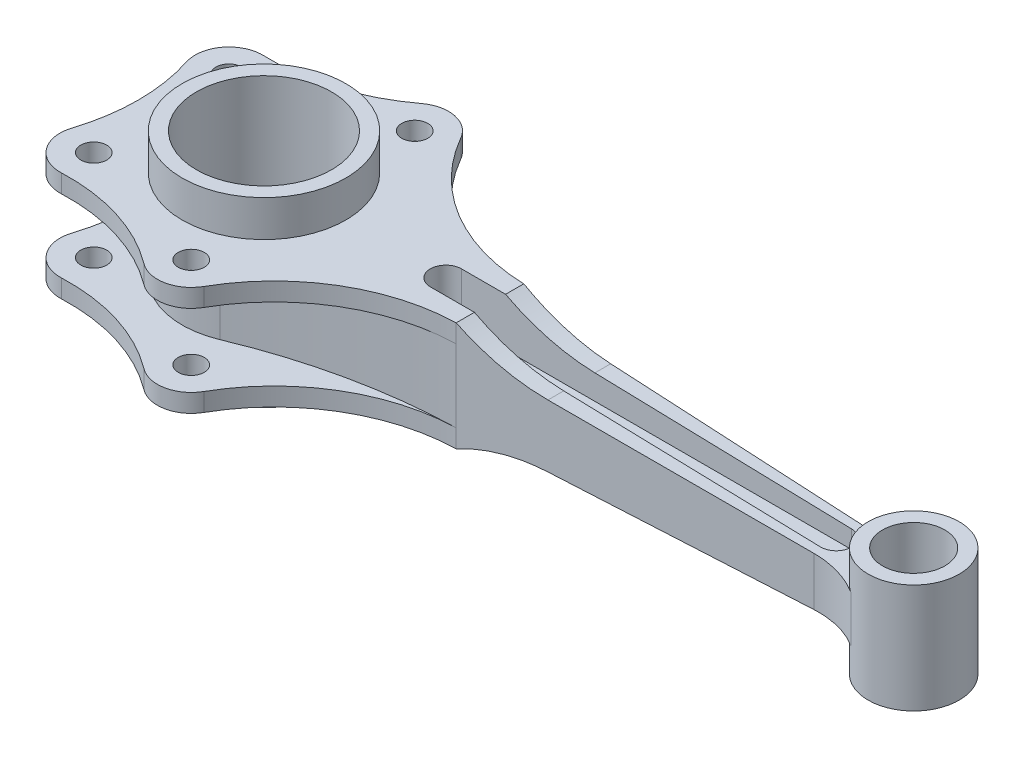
ISO-10303-21;
HEADER;
FILE_DESCRIPTION(('STEP AP214'),'2;1');
FILE_NAME('part.step','',(''),(''),'','','');
FILE_SCHEMA(('AUTOMOTIVE_DESIGN { 1 0 10303 214 1 1 1 1 }'));
ENDSEC;
DATA;
#1=APPLICATION_CONTEXT('core data for automotive mechanical design processes');
#2=APPLICATION_PROTOCOL_DEFINITION('international standard','automotive_design',2000,#1);
#3=PRODUCT_CONTEXT('',#1,'mechanical');
#4=PRODUCT('Part','Part','',(#3));
#5=PRODUCT_RELATED_PRODUCT_CATEGORY('part','',(#4));
#6=PRODUCT_DEFINITION_FORMATION('','',#4);
#7=PRODUCT_DEFINITION_CONTEXT('part definition',#1,'design');
#8=PRODUCT_DEFINITION('design','',#6,#7);
#9=PRODUCT_DEFINITION_SHAPE('','',#8);
#10=(LENGTH_UNIT() NAMED_UNIT(*) SI_UNIT(.MILLI.,.METRE.));
#11=(NAMED_UNIT(*) PLANE_ANGLE_UNIT() SI_UNIT($,.RADIAN.));
#12=(NAMED_UNIT(*) SI_UNIT($,.STERADIAN.) SOLID_ANGLE_UNIT());
#13=UNCERTAINTY_MEASURE_WITH_UNIT(LENGTH_MEASURE(1.E-05),#10,'distance_accuracy_value','');
#14=(GEOMETRIC_REPRESENTATION_CONTEXT(3) GLOBAL_UNCERTAINTY_ASSIGNED_CONTEXT((#13)) GLOBAL_UNIT_ASSIGNED_CONTEXT((#10,
#11,#12)) REPRESENTATION_CONTEXT('',''));
#15=CARTESIAN_POINT('',(0.,0.,0.));
#16=DIRECTION('',(0.,0.,1.));
#17=DIRECTION('',(1.,0.,0.));
#18=AXIS2_PLACEMENT_3D('',#15,#16,#17);
#19=CARTESIAN_POINT('',(-172.548120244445,-21.,0.));
#20=DIRECTION('',(0.,1.,0.));
#21=DIRECTION('',(0.,0.,1.));
#22=AXIS2_PLACEMENT_3D('',#19,#20,#21);
#23=PLANE('',#22);
#24=CARTESIAN_POINT('',(0.,-21.,0.));
#25=DIRECTION('',(0.,1.,0.));
#26=DIRECTION('',(0.,0.,1.));
#27=AXIS2_PLACEMENT_3D('',#24,#25,#26);
#28=CIRCLE('',#27,31.5);
#29=CARTESIAN_POINT('',(0.,-21.,31.5));
#30=VERTEX_POINT('',#29);
#31=EDGE_CURVE('E519',#30,#30,#28,.F.);
#32=ORIENTED_EDGE('',*,*,#31,.F.);
#33=EDGE_LOOP('',(#32));
#34=FACE_BOUND('',#33,.T.);
#35=CARTESIAN_POINT('',(15.,-21.,43.));
#36=DIRECTION('',(0.,1.,0.));
#37=DIRECTION('',(0.,0.,1.));
#38=AXIS2_PLACEMENT_3D('',#35,#36,#37);
#39=CIRCLE('',#38,5.);
#40=CARTESIAN_POINT('',(15.,-21.,48.));
#41=VERTEX_POINT('',#40);
#42=EDGE_CURVE('E390',#41,#41,#39,.T.);
#43=ORIENTED_EDGE('',*,*,#42,.T.);
#44=EDGE_LOOP('',(#43));
#45=FACE_BOUND('',#44,.T.);
#46=CARTESIAN_POINT('',(15.,-21.,-43.));
#47=DIRECTION('',(0.,1.,0.));
#48=DIRECTION('',(0.,0.,1.));
#49=AXIS2_PLACEMENT_3D('',#46,#47,#48);
#50=CIRCLE('',#49,5.);
#51=CARTESIAN_POINT('',(15.,-21.,-38.));
#52=VERTEX_POINT('',#51);
#53=EDGE_CURVE('E380',#52,#52,#50,.T.);
#54=ORIENTED_EDGE('',*,*,#53,.T.);
#55=EDGE_LOOP('',(#54));
#56=FACE_BOUND('',#55,.T.);
#57=CARTESIAN_POINT('',(-39.5,-21.,-26.));
#58=DIRECTION('',(0.,1.,0.));
#59=DIRECTION('',(0.,0.,1.));
#60=AXIS2_PLACEMENT_3D('',#57,#58,#59);
#61=CIRCLE('',#60,5.);
#62=CARTESIAN_POINT('',(-39.5,-21.,-21.));
#63=VERTEX_POINT('',#62);
#64=EDGE_CURVE('E370',#63,#63,#61,.T.);
#65=ORIENTED_EDGE('',*,*,#64,.T.);
#66=EDGE_LOOP('',(#65));
#67=FACE_BOUND('',#66,.T.);
#68=CARTESIAN_POINT('',(-39.5,-21.,26.));
#69=DIRECTION('',(0.,1.,0.));
#70=DIRECTION('',(0.,0.,1.));
#71=AXIS2_PLACEMENT_3D('',#68,#69,#70);
#72=CIRCLE('',#71,5.);
#73=CARTESIAN_POINT('',(-39.5,-21.,31.));
#74=VERTEX_POINT('',#73);
#75=EDGE_CURVE('E360',#74,#74,#72,.T.);
#76=ORIENTED_EDGE('',*,*,#75,.T.);
#77=EDGE_LOOP('',(#76));
#78=FACE_BOUND('',#77,.T.);
#79=DIRECTION('',(1.,0.,0.));
#80=VECTOR('',#79,1.);
#81=CARTESIAN_POINT('',(70.,-21.,5.99999999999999));
#82=LINE('',#81,#80);
#83=CARTESIAN_POINT('',(70.,-21.,5.99999999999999));
#84=VERTEX_POINT('',#83);
#85=CARTESIAN_POINT('',(86.9685733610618,-21.,5.99999999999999));
#86=VERTEX_POINT('',#85);
#87=EDGE_CURVE('E318',#84,#86,#82,.T.);
#88=ORIENTED_EDGE('',*,*,#87,.T.);
#89=DIRECTION('',(0.,0.,-1.));
#90=VECTOR('',#89,1.);
#91=CARTESIAN_POINT('',(86.9685733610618,-21.,406.723331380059));
#92=LINE('',#91,#90);
#93=CARTESIAN_POINT('',(86.9685733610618,-21.,13.));
#94=VERTEX_POINT('',#93);
#95=EDGE_CURVE('E621',#86,#94,#92,.F.);
#96=ORIENTED_EDGE('',*,*,#95,.T.);
#97=CARTESIAN_POINT('',(88.9135056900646,-21.,84.9737260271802));
#98=DIRECTION('',(0.,1.,0.));
#99=DIRECTION('',(0.,0.,1.));
#100=AXIS2_PLACEMENT_3D('',#97,#98,#99);
#101=CIRCLE('',#100,72.);
#102=CARTESIAN_POINT('',(26.304418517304,-21.,49.4195110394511));
#103=VERTEX_POINT('',#102);
#104=EDGE_CURVE('E546',#103,#94,#101,.F.);
#105=ORIENTED_EDGE('',*,*,#104,.F.);
#106=CARTESIAN_POINT('',(15.,-21.,43.));
#107=DIRECTION('',(0.,1.,0.));
#108=DIRECTION('',(0.,0.,1.));
#109=AXIS2_PLACEMENT_3D('',#106,#107,#108);
#110=CIRCLE('',#109,13.);
#111=CARTESIAN_POINT('',(7.18607409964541,-21.,53.3895409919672));
#112=VERTEX_POINT('',#111);
#113=EDGE_CURVE('E543',#112,#103,#110,.T.);
#114=ORIENTED_EDGE('',*,*,#113,.F.);
#115=CARTESIAN_POINT('',(-36.091053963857,-21.,110.931614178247));
#116=DIRECTION('',(0.,1.,0.));
#117=DIRECTION('',(0.,0.,1.));
#118=AXIS2_PLACEMENT_3D('',#115,#116,#117);
#119=CIRCLE('',#118,72.);
#120=CARTESIAN_POINT('',(-38.9786317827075,-21.,38.9895409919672));
#121=VERTEX_POINT('',#120);
#122=EDGE_CURVE('E540',#121,#112,#119,.F.);
#123=ORIENTED_EDGE('',*,*,#122,.F.);
#124=CARTESIAN_POINT('',(-39.5,-21.,26.));
#125=DIRECTION('',(0.,1.,0.));
#126=DIRECTION('',(0.,0.,1.));
#127=AXIS2_PLACEMENT_3D('',#124,#125,#126);
#128=CIRCLE('',#127,13.);
#129=CARTESIAN_POINT('',(-51.8769011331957,-21.,22.0235294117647));
#130=VERTEX_POINT('',#129);
#131=EDGE_CURVE('E537',#130,#121,#128,.T.);
#132=ORIENTED_EDGE('',*,*,#131,.F.);
#133=CARTESIAN_POINT('',(-120.425892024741,-21.,0.));
#134=DIRECTION('',(0.,1.,0.));
#135=DIRECTION('',(0.,0.,1.));
#136=AXIS2_PLACEMENT_3D('',#133,#134,#135);
#137=CIRCLE('',#136,72.);
#138=CARTESIAN_POINT('',(-51.8769011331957,-21.,-22.0235294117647));
#139=VERTEX_POINT('',#138);
#140=EDGE_CURVE('E534',#139,#130,#137,.F.);
#141=ORIENTED_EDGE('',*,*,#140,.F.);
#142=CARTESIAN_POINT('',(-39.5,-21.,-26.));
#143=DIRECTION('',(0.,1.,0.));
#144=DIRECTION('',(0.,0.,1.));
#145=AXIS2_PLACEMENT_3D('',#142,#143,#144);
#146=CIRCLE('',#145,13.);
#147=CARTESIAN_POINT('',(-38.9786317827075,-21.,-38.9895409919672));
#148=VERTEX_POINT('',#147);
#149=EDGE_CURVE('E531',#139,#148,#146,.F.);
#150=ORIENTED_EDGE('',*,*,#149,.T.);
#151=CARTESIAN_POINT('',(-36.091053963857,-21.,-110.931614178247));
#152=DIRECTION('',(0.,1.,0.));
#153=DIRECTION('',(0.,0.,1.));
#154=AXIS2_PLACEMENT_3D('',#151,#152,#153);
#155=CIRCLE('',#154,72.);
#156=CARTESIAN_POINT('',(7.1860740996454,-21.,-53.3895409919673));
#157=VERTEX_POINT('',#156);
#158=EDGE_CURVE('E528',#148,#157,#155,.T.);
#159=ORIENTED_EDGE('',*,*,#158,.T.);
#160=CARTESIAN_POINT('',(15.,-21.,-43.));
#161=DIRECTION('',(0.,1.,0.));
#162=DIRECTION('',(0.,0.,1.));
#163=AXIS2_PLACEMENT_3D('',#160,#161,#162);
#164=CIRCLE('',#163,13.);
#165=CARTESIAN_POINT('',(26.304418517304,-21.,-49.4195110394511));
#166=VERTEX_POINT('',#165);
#167=EDGE_CURVE('E525',#157,#166,#164,.F.);
#168=ORIENTED_EDGE('',*,*,#167,.T.);
#169=CARTESIAN_POINT('',(88.9135056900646,-21.,-84.9737260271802));
#170=DIRECTION('',(0.,1.,0.));
#171=DIRECTION('',(0.,0.,1.));
#172=AXIS2_PLACEMENT_3D('',#169,#170,#171);
#173=CIRCLE('',#172,72.);
#174=CARTESIAN_POINT('',(86.9685733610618,-21.,-13.));
#175=VERTEX_POINT('',#174);
#176=EDGE_CURVE('E522',#166,#175,#173,.T.);
#177=ORIENTED_EDGE('',*,*,#176,.T.);
#178=CARTESIAN_POINT('',(86.9685733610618,-21.,-6.00000000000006));
#179=VERTEX_POINT('',#178);
#180=EDGE_CURVE('E622',#175,#179,#92,.F.);
#181=ORIENTED_EDGE('',*,*,#180,.T.);
#182=DIRECTION('',(-1.,0.,0.));
#183=VECTOR('',#182,1.);
#184=CARTESIAN_POINT('',(70.,-21.,-6.00000000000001));
#185=LINE('',#184,#183);
#186=CARTESIAN_POINT('',(70.,-21.,-6.00000000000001));
#187=VERTEX_POINT('',#186);
#188=EDGE_CURVE('E292',#179,#187,#185,.T.);
#189=ORIENTED_EDGE('',*,*,#188,.T.);
#190=CARTESIAN_POINT('',(70.,-21.,0.));
#191=DIRECTION('',(0.,1.,0.));
#192=DIRECTION('',(0.,0.,1.));
#193=AXIS2_PLACEMENT_3D('',#190,#191,#192);
#194=CIRCLE('',#193,6.);
#195=EDGE_CURVE('E312',#187,#84,#194,.T.);
#196=ORIENTED_EDGE('',*,*,#195,.T.);
#197=EDGE_LOOP('',(#88,#96,#105,#114,#123,#132,#141,#150,#159,#168,#177,#181,#189,#196));
#198=FACE_BOUND('',#197,.T.);
#199=ADVANCED_FACE('F26',(#34,#45,#56,#67,#78,#198),#23,.F.);
#200=CARTESIAN_POINT('',(121.3349966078,-12.,406.723331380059));
#201=DIRECTION('',(-0.026386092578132,0.999651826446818,0.));
#202=DIRECTION('',(-0.999651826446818,-0.026386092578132,0.));
#203=AXIS2_PLACEMENT_3D('',#200,#201,#202);
#204=PLANE('',#203);
#205=DIRECTION('',(-0.999651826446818,-0.026386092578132,0.));
#206=VECTOR('',#205,1.);
#207=CARTESIAN_POINT('',(121.3349966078,-12.,6.00000000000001));
#208=LINE('',#207,#206);
#209=CARTESIAN_POINT('',(220.,-9.39570934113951,5.99999999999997));
#210=VERTEX_POINT('',#209);
#211=CARTESIAN_POINT('',(121.3349966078,-12.,6.00000000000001));
#212=VERTEX_POINT('',#211);
#213=EDGE_CURVE('E308',#210,#212,#208,.T.);
#214=ORIENTED_EDGE('',*,*,#213,.F.);
#215=CARTESIAN_POINT('',(220.,-9.39570934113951,0.));
#216=DIRECTION('',(-0.026386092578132,0.999651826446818,0.));
#217=DIRECTION('',(-0.999651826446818,-0.026386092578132,0.));
#218=AXIS2_PLACEMENT_3D('',#215,#216,#217);
#219=ELLIPSE('',#218,6.00208976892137,6.);
#220=CARTESIAN_POINT('',(220.,-9.39570934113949,-6.00000000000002));
#221=VERTEX_POINT('',#220);
#222=EDGE_CURVE('E645',#221,#210,#219,.F.);
#223=ORIENTED_EDGE('',*,*,#222,.F.);
#224=DIRECTION('',(0.999651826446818,0.026386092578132,0.));
#225=VECTOR('',#224,1.);
#226=CARTESIAN_POINT('',(121.3349966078,-12.,-6.00000000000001));
#227=LINE('',#226,#225);
#228=CARTESIAN_POINT('',(121.3349966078,-12.,-6.00000000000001));
#229=VERTEX_POINT('',#228);
#230=EDGE_CURVE('E288',#229,#221,#227,.T.);
#231=ORIENTED_EDGE('',*,*,#230,.F.);
#232=DIRECTION('',(0.,0.,-1.));
#233=VECTOR('',#232,1.);
#234=CARTESIAN_POINT('',(121.3349966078,-12.,406.723331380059));
#235=LINE('',#234,#233);
#236=CARTESIAN_POINT('',(121.3349966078,-12.,-12.0713226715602));
#237=VERTEX_POINT('',#236);
#238=EDGE_CURVE('E472',#229,#237,#235,.T.);
#239=ORIENTED_EDGE('',*,*,#238,.T.);
#240=DIRECTION('',(0.999287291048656,0.0263764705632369,0.0270035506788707));
#241=VECTOR('',#240,1.);
#242=CARTESIAN_POINT('',(-170.933823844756,-19.7145181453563,-19.9692474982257));
#243=LINE('',#242,#241);
#244=CARTESIAN_POINT('',(220.984440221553,-9.36972476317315,-9.37851468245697));
#245=VERTEX_POINT('',#244);
#246=EDGE_CURVE('E490',#237,#245,#243,.T.);
#247=ORIENTED_EDGE('',*,*,#246,.T.);
#248=CARTESIAN_POINT('',(221.92989343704,-9.34476925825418,-44.3657426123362));
#249=DIRECTION('',(-0.026386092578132,0.999651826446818,0.));
#250=DIRECTION('',(-0.999651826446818,-0.026386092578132,0.));
#251=AXIS2_PLACEMENT_3D('',#248,#249,#250);
#252=ELLIPSE('',#251,35.012190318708,35.);
#253=CARTESIAN_POINT('',(240.643297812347,-8.85082365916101,-14.7885808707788));
#254=VERTEX_POINT('',#253);
#255=EDGE_CURVE('E657',#245,#254,#252,.T.);
#256=ORIENTED_EDGE('',*,*,#255,.T.);
#257=CARTESIAN_POINT('',(250.,-8.60385085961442,0.));
#258=DIRECTION('',(-0.026386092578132,0.999651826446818,0.));
#259=DIRECTION('',(-0.999651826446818,-0.026386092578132,0.));
#260=AXIS2_PLACEMENT_3D('',#257,#258,#259);
#261=ELLIPSE('',#260,17.506095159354,17.5);
#262=CARTESIAN_POINT('',(240.643297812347,-8.85082365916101,14.7885808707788));
#263=VERTEX_POINT('',#262);
#264=EDGE_CURVE('E488',#254,#263,#261,.T.);
#265=ORIENTED_EDGE('',*,*,#264,.T.);
#266=CARTESIAN_POINT('',(221.92989343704,-9.34476925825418,44.3657426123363));
#267=DIRECTION('',(-0.026386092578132,0.999651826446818,0.));
#268=DIRECTION('',(-0.999651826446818,-0.026386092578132,0.));
#269=AXIS2_PLACEMENT_3D('',#266,#267,#268);
#270=ELLIPSE('',#269,35.012190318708,35.);
#271=CARTESIAN_POINT('',(220.984440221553,-9.36972476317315,9.37851468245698));
#272=VERTEX_POINT('',#271);
#273=EDGE_CURVE('E34',#263,#272,#270,.T.);
#274=ORIENTED_EDGE('',*,*,#273,.T.);
#275=DIRECTION('',(0.999287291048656,0.0263764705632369,-0.0270035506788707));
#276=VECTOR('',#275,1.);
#277=CARTESIAN_POINT('',(-170.933823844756,-19.7145181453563,19.9692474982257));
#278=LINE('',#277,#276);
#279=CARTESIAN_POINT('',(121.3349966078,-12.,12.0713226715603));
#280=VERTEX_POINT('',#279);
#281=EDGE_CURVE('E625',#280,#272,#278,.T.);
#282=ORIENTED_EDGE('',*,*,#281,.F.);
#283=EDGE_CURVE('E479',#280,#212,#235,.T.);
#284=ORIENTED_EDGE('',*,*,#283,.T.);
#285=EDGE_LOOP('',(#214,#223,#231,#239,#247,#256,#265,#274,#282,#284));
#286=FACE_BOUND('',#285,.T.);
#287=ADVANCED_FACE('F676',(#286),#204,.F.);
#288=CARTESIAN_POINT('',(123.393111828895,-89.9728424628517,406.723331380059));
#289=DIRECTION('',(0.,0.,-1.));
#290=DIRECTION('',(-1.,0.,0.));
#291=AXIS2_PLACEMENT_3D('',#288,#289,#290);
#292=CYLINDRICAL_SURFACE('',#291,78.);
#293=CARTESIAN_POINT('',(123.393111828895,-89.9728424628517,6.00000000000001));
#294=DIRECTION('',(0.,0.,-1.));
#295=DIRECTION('',(-1.,0.,0.));
#296=AXIS2_PLACEMENT_3D('',#293,#294,#295);
#297=CIRCLE('',#296,78.);
#298=EDGE_CURVE('E643',#212,#86,#297,.F.);
#299=ORIENTED_EDGE('',*,*,#298,.F.);
#300=ORIENTED_EDGE('',*,*,#283,.F.);
#301=CARTESIAN_POINT('',(123.393111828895,-89.9728424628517,12.015706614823));
#302=DIRECTION('',(-0.0270129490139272,0.,-0.999635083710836));
#303=DIRECTION('',(0.999635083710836,0.,-0.0270129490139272));
#304=AXIS2_PLACEMENT_3D('',#301,#302,#303);
#305=ELLIPSE('',#304,78.0284738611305,78.);
#306=EDGE_CURVE('E482',#94,#280,#305,.T.);
#307=ORIENTED_EDGE('',*,*,#306,.F.);
#308=ORIENTED_EDGE('',*,*,#95,.F.);
#309=EDGE_LOOP('',(#299,#300,#307,#308));
#310=FACE_BOUND('',#309,.T.);
#311=ADVANCED_FACE('F708',(#310),#292,.F.);
#312=CARTESIAN_POINT('',(123.393111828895,-89.9728424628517,-6.00000000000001));
#313=DIRECTION('',(0.,0.,1.));
#314=DIRECTION('',(1.,0.,0.));
#315=AXIS2_PLACEMENT_3D('',#312,#313,#314);
#316=CIRCLE('',#315,78.);
#317=EDGE_CURVE('E641',#179,#229,#316,.F.);
#318=ORIENTED_EDGE('',*,*,#317,.F.);
#319=ORIENTED_EDGE('',*,*,#180,.F.);
#320=CARTESIAN_POINT('',(123.393111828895,-89.9728424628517,-12.0157066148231));
#321=DIRECTION('',(0.0270129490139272,0.,-0.999635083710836));
#322=DIRECTION('',(-0.999635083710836,0.,-0.0270129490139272));
#323=AXIS2_PLACEMENT_3D('',#320,#321,#322);
#324=ELLIPSE('',#323,78.0284738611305,78.);
#325=EDGE_CURVE('E485',#175,#237,#324,.T.);
#326=ORIENTED_EDGE('',*,*,#325,.T.);
#327=ORIENTED_EDGE('',*,*,#238,.F.);
#328=EDGE_LOOP('',(#318,#319,#326,#327));
#329=FACE_BOUND('',#328,.T.);
#330=ADVANCED_FACE('F692',(#329),#292,.F.);
#331=CARTESIAN_POINT('',(123.393111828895,89.9728424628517,406.723331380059));
#332=DIRECTION('',(0.,0.,-1.));
#333=DIRECTION('',(-1.,0.,0.));
#334=AXIS2_PLACEMENT_3D('',#331,#332,#333);
#335=CYLINDRICAL_SURFACE('',#334,78.);
#336=CARTESIAN_POINT('',(123.393111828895,89.9728424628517,-6.00000000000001));
#337=DIRECTION('',(0.,0.,-1.));
#338=DIRECTION('',(-1.,0.,0.));
#339=AXIS2_PLACEMENT_3D('',#336,#337,#338);
#340=CIRCLE('',#339,78.);
#341=CARTESIAN_POINT('',(121.3349966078,12.,-6.00000000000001));
#342=VERTEX_POINT('',#341);
#343=CARTESIAN_POINT('',(86.9685733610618,21.,-6.00000000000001));
#344=VERTEX_POINT('',#343);
#345=EDGE_CURVE('E637',#342,#344,#340,.T.);
#346=ORIENTED_EDGE('',*,*,#345,.F.);
#347=DIRECTION('',(0.,0.,-1.));
#348=VECTOR('',#347,1.);
#349=CARTESIAN_POINT('',(121.3349966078,12.,406.723331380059));
#350=LINE('',#349,#348);
#351=CARTESIAN_POINT('',(121.3349966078,12.,-12.0713226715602));
#352=VERTEX_POINT('',#351);
#353=EDGE_CURVE('E493',#342,#352,#350,.T.);
#354=ORIENTED_EDGE('',*,*,#353,.T.);
#355=CARTESIAN_POINT('',(123.393111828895,89.9728424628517,-12.0157066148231));
#356=DIRECTION('',(0.0270129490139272,0.,-0.999635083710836));
#357=DIRECTION('',(-0.999635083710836,0.,-0.0270129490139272));
#358=AXIS2_PLACEMENT_3D('',#355,#356,#357);
#359=ELLIPSE('',#358,78.0284738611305,78.);
#360=CARTESIAN_POINT('',(86.9685733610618,21.,-13.));
#361=VERTEX_POINT('',#360);
#362=EDGE_CURVE('E499',#361,#352,#359,.F.);
#363=ORIENTED_EDGE('',*,*,#362,.F.);
#364=DIRECTION('',(0.,0.,-1.));
#365=VECTOR('',#364,1.);
#366=CARTESIAN_POINT('',(86.9685733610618,21.,406.723331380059));
#367=LINE('',#366,#365);
#368=EDGE_CURVE('E615',#344,#361,#367,.T.);
#369=ORIENTED_EDGE('',*,*,#368,.F.);
#370=EDGE_LOOP('',(#346,#354,#363,#369));
#371=FACE_BOUND('',#370,.T.);
#372=ADVANCED_FACE('F822',(#371),#335,.F.);
#373=CARTESIAN_POINT('',(88.9135056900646,21.,-84.9737260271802));
#374=DIRECTION('',(0.,-1.,0.));
#375=DIRECTION('',(0.,0.,-1.));
#376=AXIS2_PLACEMENT_3D('',#373,#374,#375);
#377=CYLINDRICAL_SURFACE('',#376,72.);
#378=DIRECTION('',(0.,-1.,0.));
#379=VECTOR('',#378,1.);
#380=CARTESIAN_POINT('',(26.304418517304,21.,-49.4195110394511));
#381=LINE('',#380,#379);
#382=CARTESIAN_POINT('',(26.304418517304,-14.,-49.4195110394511));
#383=VERTEX_POINT('',#382);
#384=EDGE_CURVE('E607',#383,#166,#381,.T.);
#385=ORIENTED_EDGE('',*,*,#384,.F.);
#386=CARTESIAN_POINT('',(88.9135056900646,-14.,-84.9737260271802));
#387=DIRECTION('',(0.,-1.,0.));
#388=DIRECTION('',(0.,0.,1.));
#389=AXIS2_PLACEMENT_3D('',#386,#387,#388);
#390=CIRCLE('',#389,72.);
#391=CARTESIAN_POINT('',(86.9685733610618,-14.,-13.));
#392=VERTEX_POINT('',#391);
#393=EDGE_CURVE('E466',#392,#383,#390,.T.);
#394=ORIENTED_EDGE('',*,*,#393,.F.);
#395=DIRECTION('',(0.,-1.,0.));
#396=VECTOR('',#395,1.);
#397=CARTESIAN_POINT('',(86.9685733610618,21.,-13.));
#398=LINE('',#397,#396);
#399=EDGE_CURVE('E611',#392,#175,#398,.T.);
#400=ORIENTED_EDGE('',*,*,#399,.T.);
#401=ORIENTED_EDGE('',*,*,#176,.F.);
#402=EDGE_LOOP('',(#385,#394,#400,#401));
#403=FACE_BOUND('',#402,.T.);
#404=ADVANCED_FACE('F689',(#403),#377,.F.);
#405=CARTESIAN_POINT('',(15.,21.,-43.));
#406=DIRECTION('',(0.,-1.,0.));
#407=DIRECTION('',(0.,0.,-1.));
#408=AXIS2_PLACEMENT_3D('',#405,#406,#407);
#409=CYLINDRICAL_SURFACE('',#408,13.);
#410=DIRECTION('',(0.,-1.,0.));
#411=VECTOR('',#410,1.);
#412=CARTESIAN_POINT('',(7.1860740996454,21.,-53.3895409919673));
#413=LINE('',#412,#411);
#414=CARTESIAN_POINT('',(7.1860740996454,-14.,-53.3895409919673));
#415=VERTEX_POINT('',#414);
#416=EDGE_CURVE('E603',#415,#157,#413,.T.);
#417=ORIENTED_EDGE('',*,*,#416,.F.);
#418=CARTESIAN_POINT('',(15.,-14.,-43.));
#419=DIRECTION('',(0.,1.,0.));
#420=DIRECTION('',(0.,0.,1.));
#421=AXIS2_PLACEMENT_3D('',#418,#419,#420);
#422=CIRCLE('',#421,13.);
#423=EDGE_CURVE('E440',#383,#415,#422,.T.);
#424=ORIENTED_EDGE('',*,*,#423,.F.);
#425=ORIENTED_EDGE('',*,*,#384,.T.);
#426=ORIENTED_EDGE('',*,*,#167,.F.);
#427=EDGE_LOOP('',(#417,#424,#425,#426));
#428=FACE_BOUND('',#427,.T.);
#429=ADVANCED_FACE('F746',(#428),#409,.T.);
#430=CARTESIAN_POINT('',(-36.091053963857,21.,-110.931614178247));
#431=DIRECTION('',(0.,-1.,0.));
#432=DIRECTION('',(0.,0.,-1.));
#433=AXIS2_PLACEMENT_3D('',#430,#431,#432);
#434=CYLINDRICAL_SURFACE('',#433,72.);
#435=DIRECTION('',(0.,-1.,0.));
#436=VECTOR('',#435,1.);
#437=CARTESIAN_POINT('',(-38.9786317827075,21.,-38.9895409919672));
#438=LINE('',#437,#436);
#439=CARTESIAN_POINT('',(-38.9786317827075,-14.,-38.9895409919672));
#440=VERTEX_POINT('',#439);
#441=EDGE_CURVE('E599',#440,#148,#438,.T.);
#442=ORIENTED_EDGE('',*,*,#441,.F.);
#443=CARTESIAN_POINT('',(-36.091053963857,-14.,-110.931614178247));
#444=DIRECTION('',(0.,-1.,0.));
#445=DIRECTION('',(0.,0.,1.));
#446=AXIS2_PLACEMENT_3D('',#443,#444,#445);
#447=CIRCLE('',#446,72.);
#448=EDGE_CURVE('E442',#415,#440,#447,.T.);
#449=ORIENTED_EDGE('',*,*,#448,.F.);
#450=ORIENTED_EDGE('',*,*,#416,.T.);
#451=ORIENTED_EDGE('',*,*,#158,.F.);
#452=EDGE_LOOP('',(#442,#449,#450,#451));
#453=FACE_BOUND('',#452,.T.);
#454=ADVANCED_FACE('F742',(#453),#434,.F.);
#455=CARTESIAN_POINT('',(-39.5,21.,-26.));
#456=DIRECTION('',(0.,-1.,0.));
#457=DIRECTION('',(0.,0.,-1.));
#458=AXIS2_PLACEMENT_3D('',#455,#456,#457);
#459=CYLINDRICAL_SURFACE('',#458,13.);
#460=DIRECTION('',(0.,-1.,0.));
#461=VECTOR('',#460,1.);
#462=CARTESIAN_POINT('',(-51.8769011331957,21.,-22.0235294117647));
#463=LINE('',#462,#461);
#464=CARTESIAN_POINT('',(-51.8769011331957,-14.,-22.0235294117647));
#465=VERTEX_POINT('',#464);
#466=EDGE_CURVE('E595',#465,#139,#463,.T.);
#467=ORIENTED_EDGE('',*,*,#466,.F.);
#468=CARTESIAN_POINT('',(-39.5,-14.,-26.));
#469=DIRECTION('',(0.,1.,0.));
#470=DIRECTION('',(0.,0.,1.));
#471=AXIS2_PLACEMENT_3D('',#468,#469,#470);
#472=CIRCLE('',#471,13.);
#473=EDGE_CURVE('E444',#440,#465,#472,.T.);
#474=ORIENTED_EDGE('',*,*,#473,.F.);
#475=ORIENTED_EDGE('',*,*,#441,.T.);
#476=ORIENTED_EDGE('',*,*,#149,.F.);
#477=EDGE_LOOP('',(#467,#474,#475,#476));
#478=FACE_BOUND('',#477,.T.);
#479=ADVANCED_FACE('F736',(#478),#459,.T.);
#480=CARTESIAN_POINT('',(-120.425892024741,21.,0.));
#481=DIRECTION('',(0.,-1.,0.));
#482=DIRECTION('',(0.,0.,-1.));
#483=AXIS2_PLACEMENT_3D('',#480,#481,#482);
#484=CYLINDRICAL_SURFACE('',#483,72.);
#485=CARTESIAN_POINT('',(-120.425892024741,-14.,0.));
#486=DIRECTION('',(0.,-1.,0.));
#487=DIRECTION('',(0.,0.,1.));
#488=AXIS2_PLACEMENT_3D('',#485,#486,#487);
#489=CIRCLE('',#488,72.);
#490=CARTESIAN_POINT('',(-51.8769011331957,-14.,22.0235294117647));
#491=VERTEX_POINT('',#490);
#492=EDGE_CURVE('E446',#465,#491,#489,.T.);
#493=ORIENTED_EDGE('',*,*,#492,.F.);
#494=ORIENTED_EDGE('',*,*,#466,.T.);
#495=ORIENTED_EDGE('',*,*,#140,.T.);
#496=DIRECTION('',(0.,-1.,0.));
#497=VECTOR('',#496,1.);
#498=CARTESIAN_POINT('',(-51.8769011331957,21.,22.0235294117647));
#499=LINE('',#498,#497);
#500=EDGE_CURVE('E591',#491,#130,#499,.T.);
#501=ORIENTED_EDGE('',*,*,#500,.F.);
#502=EDGE_LOOP('',(#493,#494,#495,#501));
#503=FACE_BOUND('',#502,.T.);
#504=ADVANCED_FACE('F864',(#503),#484,.F.);
#505=CARTESIAN_POINT('',(-39.5,21.,26.));
#506=DIRECTION('',(0.,-1.,0.));
#507=DIRECTION('',(0.,0.,-1.));
#508=AXIS2_PLACEMENT_3D('',#505,#506,#507);
#509=CYLINDRICAL_SURFACE('',#508,13.);
#510=CARTESIAN_POINT('',(-39.5,-14.,26.));
#511=DIRECTION('',(0.,1.,0.));
#512=DIRECTION('',(0.,0.,1.));
#513=AXIS2_PLACEMENT_3D('',#510,#511,#512);
#514=CIRCLE('',#513,13.);
#515=CARTESIAN_POINT('',(-38.9786317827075,-14.,38.9895409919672));
#516=VERTEX_POINT('',#515);
#517=EDGE_CURVE('E448',#491,#516,#514,.T.);
#518=ORIENTED_EDGE('',*,*,#517,.F.);
#519=ORIENTED_EDGE('',*,*,#500,.T.);
#520=ORIENTED_EDGE('',*,*,#131,.T.);
#521=DIRECTION('',(0.,-1.,0.));
#522=VECTOR('',#521,1.);
#523=CARTESIAN_POINT('',(-38.9786317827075,21.,38.9895409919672));
#524=LINE('',#523,#522);
#525=EDGE_CURVE('E587',#516,#121,#524,.T.);
#526=ORIENTED_EDGE('',*,*,#525,.F.);
#527=EDGE_LOOP('',(#518,#519,#520,#526));
#528=FACE_BOUND('',#527,.T.);
#529=ADVANCED_FACE('F729',(#528),#509,.T.);
#530=CARTESIAN_POINT('',(-36.091053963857,21.,110.931614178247));
#531=DIRECTION('',(0.,-1.,0.));
#532=DIRECTION('',(0.,0.,-1.));
#533=AXIS2_PLACEMENT_3D('',#530,#531,#532);
#534=CYLINDRICAL_SURFACE('',#533,72.);
#535=CARTESIAN_POINT('',(-36.091053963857,-14.,110.931614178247));
#536=DIRECTION('',(0.,-1.,0.));
#537=DIRECTION('',(0.,0.,1.));
#538=AXIS2_PLACEMENT_3D('',#535,#536,#537);
#539=CIRCLE('',#538,72.);
#540=CARTESIAN_POINT('',(7.1860740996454,-14.,53.3895409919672));
#541=VERTEX_POINT('',#540);
#542=EDGE_CURVE('E450',#516,#541,#539,.T.);
#543=ORIENTED_EDGE('',*,*,#542,.F.);
#544=ORIENTED_EDGE('',*,*,#525,.T.);
#545=ORIENTED_EDGE('',*,*,#122,.T.);
#546=DIRECTION('',(0.,-1.,0.));
#547=VECTOR('',#546,1.);
#548=CARTESIAN_POINT('',(7.18607409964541,21.,53.3895409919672));
#549=LINE('',#548,#547);
#550=EDGE_CURVE('E583',#541,#112,#549,.T.);
#551=ORIENTED_EDGE('',*,*,#550,.F.);
#552=EDGE_LOOP('',(#543,#544,#545,#551));
#553=FACE_BOUND('',#552,.T.);
#554=ADVANCED_FACE('F725',(#553),#534,.F.);
#555=CARTESIAN_POINT('',(15.,21.,43.));
#556=DIRECTION('',(0.,-1.,0.));
#557=DIRECTION('',(0.,0.,-1.));
#558=AXIS2_PLACEMENT_3D('',#555,#556,#557);
#559=CYLINDRICAL_SURFACE('',#558,13.);
#560=CARTESIAN_POINT('',(15.,-14.,43.));
#561=DIRECTION('',(0.,1.,0.));
#562=DIRECTION('',(0.,0.,1.));
#563=AXIS2_PLACEMENT_3D('',#560,#561,#562);
#564=CIRCLE('',#563,13.);
#565=CARTESIAN_POINT('',(26.304418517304,-14.,49.4195110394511));
#566=VERTEX_POINT('',#565);
#567=EDGE_CURVE('E452',#541,#566,#564,.T.);
#568=ORIENTED_EDGE('',*,*,#567,.F.);
#569=ORIENTED_EDGE('',*,*,#550,.T.);
#570=ORIENTED_EDGE('',*,*,#113,.T.);
#571=DIRECTION('',(0.,-1.,0.));
#572=VECTOR('',#571,1.);
#573=CARTESIAN_POINT('',(26.304418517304,21.,49.4195110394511));
#574=LINE('',#573,#572);
#575=EDGE_CURVE('E579',#566,#103,#574,.T.);
#576=ORIENTED_EDGE('',*,*,#575,.F.);
#577=EDGE_LOOP('',(#568,#569,#570,#576));
#578=FACE_BOUND('',#577,.T.);
#579=ADVANCED_FACE('F721',(#578),#559,.T.);
#580=CARTESIAN_POINT('',(88.9135056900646,21.,84.9737260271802));
#581=DIRECTION('',(0.,-1.,0.));
#582=DIRECTION('',(0.,0.,-1.));
#583=AXIS2_PLACEMENT_3D('',#580,#581,#582);
#584=CYLINDRICAL_SURFACE('',#583,72.);
#585=CARTESIAN_POINT('',(88.9135056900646,-14.,84.9737260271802));
#586=DIRECTION('',(0.,-1.,0.));
#587=DIRECTION('',(0.,0.,1.));
#588=AXIS2_PLACEMENT_3D('',#585,#586,#587);
#589=CIRCLE('',#588,72.);
#590=CARTESIAN_POINT('',(86.9685733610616,-14.,13.));
#591=VERTEX_POINT('',#590);
#592=EDGE_CURVE('E454',#566,#591,#589,.T.);
#593=ORIENTED_EDGE('',*,*,#592,.F.);
#594=ORIENTED_EDGE('',*,*,#575,.T.);
#595=ORIENTED_EDGE('',*,*,#104,.T.);
#596=DIRECTION('',(0.,-1.,0.));
#597=VECTOR('',#596,1.);
#598=CARTESIAN_POINT('',(86.9685733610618,21.,13.));
#599=LINE('',#598,#597);
#600=EDGE_CURVE('E575',#591,#94,#599,.T.);
#601=ORIENTED_EDGE('',*,*,#600,.F.);
#602=EDGE_LOOP('',(#593,#594,#595,#601));
#603=FACE_BOUND('',#602,.T.);
#604=ADVANCED_FACE('F713',(#603),#584,.F.);
#605=CARTESIAN_POINT('',(-172.007710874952,21.,-19.9982669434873));
#606=DIRECTION('',(0.0270129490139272,0.,-0.999635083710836));
#607=DIRECTION('',(-0.999635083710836,0.,-0.0270129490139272));
#608=AXIS2_PLACEMENT_3D('',#605,#606,#607);
#609=PLANE('',#608);
#610=DIRECTION('',(0.999287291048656,-0.0263764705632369,0.0270035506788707));
#611=VECTOR('',#610,1.);
#612=CARTESIAN_POINT('',(-172.040846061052,19.74373830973,-19.9991623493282));
#613=LINE('',#612,#611);
#614=CARTESIAN_POINT('',(220.984440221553,9.36972476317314,-9.37851468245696));
#615=VERTEX_POINT('',#614);
#616=EDGE_CURVE('E504',#352,#615,#613,.T.);
#617=ORIENTED_EDGE('',*,*,#616,.T.);
#618=DIRECTION('',(0.,-1.,0.));
#619=VECTOR('',#618,1.);
#620=CARTESIAN_POINT('',(220.984440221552,21.,-9.37851468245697));
#621=LINE('',#620,#619);
#622=EDGE_CURVE('E647',#615,#245,#621,.T.);
#623=ORIENTED_EDGE('',*,*,#622,.T.);
#624=ORIENTED_EDGE('',*,*,#246,.F.);
#625=ORIENTED_EDGE('',*,*,#325,.F.);
#626=ORIENTED_EDGE('',*,*,#399,.F.);
#627=DIRECTION('',(0.,1.,0.));
#628=VECTOR('',#627,1.);
#629=CARTESIAN_POINT('',(86.9685733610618,-14.,-13.));
#630=LINE('',#629,#628);
#631=CARTESIAN_POINT('',(86.9685733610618,14.,-13.));
#632=VERTEX_POINT('',#631);
#633=EDGE_CURVE('E469',#392,#632,#630,.T.);
#634=ORIENTED_EDGE('',*,*,#633,.T.);
#635=EDGE_CURVE('E612',#361,#632,#398,.T.);
#636=ORIENTED_EDGE('',*,*,#635,.F.);
#637=ORIENTED_EDGE('',*,*,#362,.T.);
#638=EDGE_LOOP('',(#617,#623,#624,#625,#626,#634,#636,#637));
#639=FACE_BOUND('',#638,.T.);
#640=ADVANCED_FACE('F28',(#639),#609,.T.);
#641=CARTESIAN_POINT('',(-172.007710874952,21.,19.9982669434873));
#642=DIRECTION('',(-0.0270129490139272,0.,-0.999635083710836));
#643=DIRECTION('',(-0.999635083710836,0.,0.0270129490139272));
#644=AXIS2_PLACEMENT_3D('',#641,#642,#643);
#645=PLANE('',#644);
#646=ORIENTED_EDGE('',*,*,#281,.T.);
#647=DIRECTION('',(0.,1.,0.));
#648=VECTOR('',#647,1.);
#649=CARTESIAN_POINT('',(220.984440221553,9.00000000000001,9.37851468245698));
#650=LINE('',#649,#648);
#651=CARTESIAN_POINT('',(220.984440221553,9.36972476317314,9.37851468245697));
#652=VERTEX_POINT('',#651);
#653=EDGE_CURVE('E41',#272,#652,#650,.T.);
#654=ORIENTED_EDGE('',*,*,#653,.T.);
#655=DIRECTION('',(0.999287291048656,-0.0263764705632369,-0.0270035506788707));
#656=VECTOR('',#655,1.);
#657=CARTESIAN_POINT('',(-172.040846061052,19.74373830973,19.9991623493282));
#658=LINE('',#657,#656);
#659=CARTESIAN_POINT('',(121.3349966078,12.,12.0713226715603));
#660=VERTEX_POINT('',#659);
#661=EDGE_CURVE('E619',#660,#652,#658,.T.);
#662=ORIENTED_EDGE('',*,*,#661,.F.);
#663=CARTESIAN_POINT('',(123.393111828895,89.9728424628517,12.015706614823));
#664=DIRECTION('',(-0.0270129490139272,0.,-0.999635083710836));
#665=DIRECTION('',(0.999635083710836,0.,-0.0270129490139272));
#666=AXIS2_PLACEMENT_3D('',#663,#664,#665);
#667=ELLIPSE('',#666,78.0284738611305,78.);
#668=CARTESIAN_POINT('',(86.9685733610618,21.,13.));
#669=VERTEX_POINT('',#668);
#670=EDGE_CURVE('E497',#669,#660,#667,.F.);
#671=ORIENTED_EDGE('',*,*,#670,.F.);
#672=CARTESIAN_POINT('',(86.9685733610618,14.,13.));
#673=VERTEX_POINT('',#672);
#674=EDGE_CURVE('E576',#669,#673,#599,.T.);
#675=ORIENTED_EDGE('',*,*,#674,.T.);
#676=DIRECTION('',(0.,1.,0.));
#677=VECTOR('',#676,1.);
#678=CARTESIAN_POINT('',(86.9685733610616,-14.,13.));
#679=LINE('',#678,#677);
#680=EDGE_CURVE('E468',#591,#673,#679,.T.);
#681=ORIENTED_EDGE('',*,*,#680,.F.);
#682=ORIENTED_EDGE('',*,*,#600,.T.);
#683=ORIENTED_EDGE('',*,*,#306,.T.);
#684=EDGE_LOOP('',(#646,#654,#662,#671,#675,#681,#682,#683));
#685=FACE_BOUND('',#684,.T.);
#686=ADVANCED_FACE('F794',(#685),#645,.F.);
#687=CARTESIAN_POINT('',(-172.548120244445,21.,0.));
#688=DIRECTION('',(0.,1.,0.));
#689=DIRECTION('',(0.,0.,1.));
#690=AXIS2_PLACEMENT_3D('',#687,#688,#689);
#691=PLANE('',#690);
#692=DIRECTION('',(-1.,0.,0.));
#693=VECTOR('',#692,1.);
#694=CARTESIAN_POINT('',(70.,21.,-6.00000000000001));
#695=LINE('',#694,#693);
#696=CARTESIAN_POINT('',(70.,21.,-6.00000000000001));
#697=VERTEX_POINT('',#696);
#698=EDGE_CURVE('E336',#344,#697,#695,.T.);
#699=ORIENTED_EDGE('',*,*,#698,.F.);
#700=ORIENTED_EDGE('',*,*,#368,.T.);
#701=CARTESIAN_POINT('',(88.9135056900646,21.,-84.9737260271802));
#702=DIRECTION('',(0.,1.,0.));
#703=DIRECTION('',(0.,0.,1.));
#704=AXIS2_PLACEMENT_3D('',#701,#702,#703);
#705=CIRCLE('',#704,72.);
#706=CARTESIAN_POINT('',(26.304418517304,21.,-49.4195110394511));
#707=VERTEX_POINT('',#706);
#708=EDGE_CURVE('E549',#707,#361,#705,.T.);
#709=ORIENTED_EDGE('',*,*,#708,.F.);
#710=CARTESIAN_POINT('',(15.,21.,-43.));
#711=DIRECTION('',(0.,1.,0.));
#712=DIRECTION('',(0.,0.,1.));
#713=AXIS2_PLACEMENT_3D('',#710,#711,#712);
#714=CIRCLE('',#713,13.);
#715=CARTESIAN_POINT('',(7.1860740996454,21.,-53.3895409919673));
#716=VERTEX_POINT('',#715);
#717=EDGE_CURVE('E552',#716,#707,#714,.F.);
#718=ORIENTED_EDGE('',*,*,#717,.F.);
#719=CARTESIAN_POINT('',(-36.091053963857,21.,-110.931614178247));
#720=DIRECTION('',(0.,1.,0.));
#721=DIRECTION('',(0.,0.,1.));
#722=AXIS2_PLACEMENT_3D('',#719,#720,#721);
#723=CIRCLE('',#722,72.);
#724=CARTESIAN_POINT('',(-38.9786317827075,21.,-38.9895409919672));
#725=VERTEX_POINT('',#724);
#726=EDGE_CURVE('E555',#725,#716,#723,.T.);
#727=ORIENTED_EDGE('',*,*,#726,.F.);
#728=CARTESIAN_POINT('',(-39.5,21.,-26.));
#729=DIRECTION('',(0.,1.,0.));
#730=DIRECTION('',(0.,0.,1.));
#731=AXIS2_PLACEMENT_3D('',#728,#729,#730);
#732=CIRCLE('',#731,13.);
#733=CARTESIAN_POINT('',(-51.8769011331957,21.,-22.0235294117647));
#734=VERTEX_POINT('',#733);
#735=EDGE_CURVE('E558',#734,#725,#732,.F.);
#736=ORIENTED_EDGE('',*,*,#735,.F.);
#737=CARTESIAN_POINT('',(-120.425892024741,21.,0.));
#738=DIRECTION('',(0.,1.,0.));
#739=DIRECTION('',(0.,0.,1.));
#740=AXIS2_PLACEMENT_3D('',#737,#738,#739);
#741=CIRCLE('',#740,72.);
#742=CARTESIAN_POINT('',(-51.8769011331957,21.,22.0235294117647));
#743=VERTEX_POINT('',#742);
#744=EDGE_CURVE('E561',#734,#743,#741,.F.);
#745=ORIENTED_EDGE('',*,*,#744,.T.);
#746=CARTESIAN_POINT('',(-39.5,21.,26.));
#747=DIRECTION('',(0.,1.,0.));
#748=DIRECTION('',(0.,0.,1.));
#749=AXIS2_PLACEMENT_3D('',#746,#747,#748);
#750=CIRCLE('',#749,13.);
#751=CARTESIAN_POINT('',(-38.9786317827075,21.,38.9895409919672));
#752=VERTEX_POINT('',#751);
#753=EDGE_CURVE('E563',#743,#752,#750,.T.);
#754=ORIENTED_EDGE('',*,*,#753,.T.);
#755=CARTESIAN_POINT('',(-36.091053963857,21.,110.931614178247));
#756=DIRECTION('',(0.,1.,0.));
#757=DIRECTION('',(0.,0.,1.));
#758=AXIS2_PLACEMENT_3D('',#755,#756,#757);
#759=CIRCLE('',#758,72.);
#760=CARTESIAN_POINT('',(7.18607409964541,21.,53.3895409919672));
#761=VERTEX_POINT('',#760);
#762=EDGE_CURVE('E565',#752,#761,#759,.F.);
#763=ORIENTED_EDGE('',*,*,#762,.T.);
#764=CARTESIAN_POINT('',(15.,21.,43.));
#765=DIRECTION('',(0.,1.,0.));
#766=DIRECTION('',(0.,0.,1.));
#767=AXIS2_PLACEMENT_3D('',#764,#765,#766);
#768=CIRCLE('',#767,13.);
#769=CARTESIAN_POINT('',(26.304418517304,21.,49.4195110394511));
#770=VERTEX_POINT('',#769);
#771=EDGE_CURVE('E567',#761,#770,#768,.T.);
#772=ORIENTED_EDGE('',*,*,#771,.T.);
#773=CARTESIAN_POINT('',(88.9135056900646,21.,84.9737260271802));
#774=DIRECTION('',(0.,1.,0.));
#775=DIRECTION('',(0.,0.,1.));
#776=AXIS2_PLACEMENT_3D('',#773,#774,#775);
#777=CIRCLE('',#776,72.);
#778=EDGE_CURVE('E569',#770,#669,#777,.F.);
#779=ORIENTED_EDGE('',*,*,#778,.T.);
#780=CARTESIAN_POINT('',(86.9685733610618,21.,6.00000000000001));
#781=VERTEX_POINT('',#780);
#782=EDGE_CURVE('E616',#669,#781,#367,.T.);
#783=ORIENTED_EDGE('',*,*,#782,.T.);
#784=DIRECTION('',(1.,0.,0.));
#785=VECTOR('',#784,1.);
#786=CARTESIAN_POINT('',(70.,21.,5.99999999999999));
#787=LINE('',#786,#785);
#788=CARTESIAN_POINT('',(70.,21.,5.99999999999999));
#789=VERTEX_POINT('',#788);
#790=EDGE_CURVE('E334',#789,#781,#787,.T.);
#791=ORIENTED_EDGE('',*,*,#790,.F.);
#792=CARTESIAN_POINT('',(70.,21.,0.));
#793=DIRECTION('',(0.,1.,0.));
#794=DIRECTION('',(0.,0.,1.));
#795=AXIS2_PLACEMENT_3D('',#792,#793,#794);
#796=CIRCLE('',#795,6.);
#797=EDGE_CURVE('E323',#697,#789,#796,.T.);
#798=ORIENTED_EDGE('',*,*,#797,.F.);
#799=EDGE_LOOP('',(#699,#700,#709,#718,#727,#736,#745,#754,#763,#772,#779,#783,#791,#798));
#800=FACE_BOUND('',#799,.T.);
#801=CARTESIAN_POINT('',(-39.5,21.,26.));
#802=DIRECTION('',(0.,1.,0.));
#803=DIRECTION('',(0.,0.,1.));
#804=AXIS2_PLACEMENT_3D('',#801,#802,#803);
#805=CIRCLE('',#804,5.);
#806=CARTESIAN_POINT('',(-39.5,21.,31.));
#807=VERTEX_POINT('',#806);
#808=EDGE_CURVE('E353',#807,#807,#805,.T.);
#809=ORIENTED_EDGE('',*,*,#808,.F.);
#810=EDGE_LOOP('',(#809));
#811=FACE_BOUND('',#810,.T.);
#812=CARTESIAN_POINT('',(-39.5,21.,-26.));
#813=DIRECTION('',(0.,1.,0.));
#814=DIRECTION('',(0.,0.,1.));
#815=AXIS2_PLACEMENT_3D('',#812,#813,#814);
#816=CIRCLE('',#815,5.);
#817=CARTESIAN_POINT('',(-39.5,21.,-21.));
#818=VERTEX_POINT('',#817);
#819=EDGE_CURVE('E363',#818,#818,#816,.T.);
#820=ORIENTED_EDGE('',*,*,#819,.F.);
#821=EDGE_LOOP('',(#820));
#822=FACE_BOUND('',#821,.T.);
#823=CARTESIAN_POINT('',(15.,21.,-43.));
#824=DIRECTION('',(0.,1.,0.));
#825=DIRECTION('',(0.,0.,1.));
#826=AXIS2_PLACEMENT_3D('',#823,#824,#825);
#827=CIRCLE('',#826,5.);
#828=CARTESIAN_POINT('',(15.,21.,-38.));
#829=VERTEX_POINT('',#828);
#830=EDGE_CURVE('E373',#829,#829,#827,.T.);
#831=ORIENTED_EDGE('',*,*,#830,.F.);
#832=EDGE_LOOP('',(#831));
#833=FACE_BOUND('',#832,.T.);
#834=CARTESIAN_POINT('',(15.,21.,43.));
#835=DIRECTION('',(0.,1.,0.));
#836=DIRECTION('',(0.,0.,1.));
#837=AXIS2_PLACEMENT_3D('',#834,#835,#836);
#838=CIRCLE('',#837,5.);
#839=CARTESIAN_POINT('',(15.,21.,48.));
#840=VERTEX_POINT('',#839);
#841=EDGE_CURVE('E383',#840,#840,#838,.T.);
#842=ORIENTED_EDGE('',*,*,#841,.F.);
#843=EDGE_LOOP('',(#842));
#844=FACE_BOUND('',#843,.T.);
#845=CARTESIAN_POINT('',(0.,21.,0.));
#846=DIRECTION('',(0.,1.,0.));
#847=DIRECTION('',(0.,0.,1.));
#848=AXIS2_PLACEMENT_3D('',#845,#846,#847);
#849=CIRCLE('',#848,31.5);
#850=CARTESIAN_POINT('',(0.,21.,31.5));
#851=VERTEX_POINT('',#850);
#852=EDGE_CURVE('E572',#851,#851,#849,.T.);
#853=ORIENTED_EDGE('',*,*,#852,.F.);
#854=EDGE_LOOP('',(#853));
#855=FACE_BOUND('',#854,.T.);
#856=ADVANCED_FACE('F761',(#800,#811,#822,#833,#844,#855),#691,.T.);
#857=CARTESIAN_POINT('',(88.9135056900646,14.,-84.9737260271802));
#858=DIRECTION('',(0.,-1.,0.));
#859=DIRECTION('',(0.,0.,1.));
#860=AXIS2_PLACEMENT_3D('',#857,#858,#859);
#861=CIRCLE('',#860,72.);
#862=CARTESIAN_POINT('',(26.304418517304,14.,-49.4195110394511));
#863=VERTEX_POINT('',#862);
#864=EDGE_CURVE('E437',#632,#863,#861,.T.);
#865=ORIENTED_EDGE('',*,*,#864,.T.);
#866=EDGE_CURVE('E608',#707,#863,#381,.T.);
#867=ORIENTED_EDGE('',*,*,#866,.F.);
#868=ORIENTED_EDGE('',*,*,#708,.T.);
#869=ORIENTED_EDGE('',*,*,#635,.T.);
#870=EDGE_LOOP('',(#865,#867,#868,#869));
#871=FACE_BOUND('',#870,.T.);
#872=ADVANCED_FACE('F756',(#871),#377,.F.);
#873=CARTESIAN_POINT('',(15.,14.,-43.));
#874=DIRECTION('',(0.,1.,0.));
#875=DIRECTION('',(0.,0.,1.));
#876=AXIS2_PLACEMENT_3D('',#873,#874,#875);
#877=CIRCLE('',#876,13.);
#878=CARTESIAN_POINT('',(7.1860740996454,14.,-53.3895409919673));
#879=VERTEX_POINT('',#878);
#880=EDGE_CURVE('E405',#863,#879,#877,.T.);
#881=ORIENTED_EDGE('',*,*,#880,.T.);
#882=EDGE_CURVE('E604',#716,#879,#413,.T.);
#883=ORIENTED_EDGE('',*,*,#882,.F.);
#884=ORIENTED_EDGE('',*,*,#717,.T.);
#885=ORIENTED_EDGE('',*,*,#866,.T.);
#886=EDGE_LOOP('',(#881,#883,#884,#885));
#887=FACE_BOUND('',#886,.T.);
#888=ADVANCED_FACE('F766',(#887),#409,.T.);
#889=CARTESIAN_POINT('',(-36.091053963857,14.,-110.931614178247));
#890=DIRECTION('',(0.,-1.,0.));
#891=DIRECTION('',(0.,0.,1.));
#892=AXIS2_PLACEMENT_3D('',#889,#890,#891);
#893=CIRCLE('',#892,72.);
#894=CARTESIAN_POINT('',(-38.9786317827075,14.,-38.9895409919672));
#895=VERTEX_POINT('',#894);
#896=EDGE_CURVE('E408',#879,#895,#893,.T.);
#897=ORIENTED_EDGE('',*,*,#896,.T.);
#898=EDGE_CURVE('E600',#725,#895,#438,.T.);
#899=ORIENTED_EDGE('',*,*,#898,.F.);
#900=ORIENTED_EDGE('',*,*,#726,.T.);
#901=ORIENTED_EDGE('',*,*,#882,.T.);
#902=EDGE_LOOP('',(#897,#899,#900,#901));
#903=FACE_BOUND('',#902,.T.);
#904=ADVANCED_FACE('F768',(#903),#434,.F.);
#905=CARTESIAN_POINT('',(-39.5,14.,-26.));
#906=DIRECTION('',(0.,1.,0.));
#907=DIRECTION('',(0.,0.,1.));
#908=AXIS2_PLACEMENT_3D('',#905,#906,#907);
#909=CIRCLE('',#908,13.);
#910=CARTESIAN_POINT('',(-51.8769011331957,14.,-22.0235294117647));
#911=VERTEX_POINT('',#910);
#912=EDGE_CURVE('E411',#895,#911,#909,.T.);
#913=ORIENTED_EDGE('',*,*,#912,.T.);
#914=EDGE_CURVE('E596',#734,#911,#463,.T.);
#915=ORIENTED_EDGE('',*,*,#914,.F.);
#916=ORIENTED_EDGE('',*,*,#735,.T.);
#917=ORIENTED_EDGE('',*,*,#898,.T.);
#918=EDGE_LOOP('',(#913,#915,#916,#917));
#919=FACE_BOUND('',#918,.T.);
#920=ADVANCED_FACE('F771',(#919),#459,.T.);
#921=ORIENTED_EDGE('',*,*,#914,.T.);
#922=CARTESIAN_POINT('',(-120.425892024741,14.,0.));
#923=DIRECTION('',(0.,-1.,0.));
#924=DIRECTION('',(0.,0.,1.));
#925=AXIS2_PLACEMENT_3D('',#922,#923,#924);
#926=CIRCLE('',#925,72.);
#927=CARTESIAN_POINT('',(-51.8769011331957,14.,22.0235294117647));
#928=VERTEX_POINT('',#927);
#929=EDGE_CURVE('E414',#911,#928,#926,.T.);
#930=ORIENTED_EDGE('',*,*,#929,.T.);
#931=EDGE_CURVE('E592',#743,#928,#499,.T.);
#932=ORIENTED_EDGE('',*,*,#931,.F.);
#933=ORIENTED_EDGE('',*,*,#744,.F.);
#934=EDGE_LOOP('',(#921,#930,#932,#933));
#935=FACE_BOUND('',#934,.T.);
#936=ADVANCED_FACE('F775',(#935),#484,.F.);
#937=ORIENTED_EDGE('',*,*,#931,.T.);
#938=CARTESIAN_POINT('',(-39.5,14.,26.));
#939=DIRECTION('',(0.,1.,0.));
#940=DIRECTION('',(0.,0.,1.));
#941=AXIS2_PLACEMENT_3D('',#938,#939,#940);
#942=CIRCLE('',#941,13.);
#943=CARTESIAN_POINT('',(-38.9786317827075,14.,38.9895409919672));
#944=VERTEX_POINT('',#943);
#945=EDGE_CURVE('E417',#928,#944,#942,.T.);
#946=ORIENTED_EDGE('',*,*,#945,.T.);
#947=EDGE_CURVE('E588',#752,#944,#524,.T.);
#948=ORIENTED_EDGE('',*,*,#947,.F.);
#949=ORIENTED_EDGE('',*,*,#753,.F.);
#950=EDGE_LOOP('',(#937,#946,#948,#949));
#951=FACE_BOUND('',#950,.T.);
#952=ADVANCED_FACE('F781',(#951),#509,.T.);
#953=ORIENTED_EDGE('',*,*,#947,.T.);
#954=CARTESIAN_POINT('',(-36.091053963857,14.,110.931614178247));
#955=DIRECTION('',(0.,-1.,0.));
#956=DIRECTION('',(0.,0.,1.));
#957=AXIS2_PLACEMENT_3D('',#954,#955,#956);
#958=CIRCLE('',#957,72.);
#959=CARTESIAN_POINT('',(7.1860740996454,14.,53.3895409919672));
#960=VERTEX_POINT('',#959);
#961=EDGE_CURVE('E420',#944,#960,#958,.T.);
#962=ORIENTED_EDGE('',*,*,#961,.T.);
#963=EDGE_CURVE('E584',#761,#960,#549,.T.);
#964=ORIENTED_EDGE('',*,*,#963,.F.);
#965=ORIENTED_EDGE('',*,*,#762,.F.);
#966=EDGE_LOOP('',(#953,#962,#964,#965));
#967=FACE_BOUND('',#966,.T.);
#968=ADVANCED_FACE('F783',(#967),#534,.F.);
#969=ORIENTED_EDGE('',*,*,#963,.T.);
#970=CARTESIAN_POINT('',(15.,14.,43.));
#971=DIRECTION('',(0.,1.,0.));
#972=DIRECTION('',(0.,0.,1.));
#973=AXIS2_PLACEMENT_3D('',#970,#971,#972);
#974=CIRCLE('',#973,13.);
#975=CARTESIAN_POINT('',(26.304418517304,14.,49.4195110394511));
#976=VERTEX_POINT('',#975);
#977=EDGE_CURVE('E423',#960,#976,#974,.T.);
#978=ORIENTED_EDGE('',*,*,#977,.T.);
#979=EDGE_CURVE('E580',#770,#976,#574,.T.);
#980=ORIENTED_EDGE('',*,*,#979,.F.);
#981=ORIENTED_EDGE('',*,*,#771,.F.);
#982=EDGE_LOOP('',(#969,#978,#980,#981));
#983=FACE_BOUND('',#982,.T.);
#984=ADVANCED_FACE('F787',(#983),#559,.T.);
#985=ORIENTED_EDGE('',*,*,#979,.T.);
#986=CARTESIAN_POINT('',(88.9135056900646,14.,84.9737260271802));
#987=DIRECTION('',(0.,-1.,0.));
#988=DIRECTION('',(0.,0.,1.));
#989=AXIS2_PLACEMENT_3D('',#986,#987,#988);
#990=CIRCLE('',#989,72.);
#991=EDGE_CURVE('E426',#976,#673,#990,.T.);
#992=ORIENTED_EDGE('',*,*,#991,.T.);
#993=ORIENTED_EDGE('',*,*,#674,.F.);
#994=ORIENTED_EDGE('',*,*,#778,.F.);
#995=EDGE_LOOP('',(#985,#992,#993,#994));
#996=FACE_BOUND('',#995,.T.);
#997=ADVANCED_FACE('F792',(#996),#584,.F.);
#998=CARTESIAN_POINT('',(0.,35.,0.));
#999=DIRECTION('',(0.,-1.,0.));
#1000=DIRECTION('',(0.,0.,-1.));
#1001=AXIS2_PLACEMENT_3D('',#998,#999,#1000);
#1002=CYLINDRICAL_SURFACE('',#1001,31.5);
#1003=CARTESIAN_POINT('',(0.,-35.,0.));
#1004=DIRECTION('',(0.,1.,0.));
#1005=DIRECTION('',(0.,0.,1.));
#1006=AXIS2_PLACEMENT_3D('',#1003,#1004,#1005);
#1007=CIRCLE('',#1006,31.5);
#1008=CARTESIAN_POINT('',(0.,-35.,31.5));
#1009=VERTEX_POINT('',#1008);
#1010=EDGE_CURVE('E510',#1009,#1009,#1007,.T.);
#1011=ORIENTED_EDGE('',*,*,#1010,.T.);
#1012=EDGE_LOOP('',(#1011));
#1013=FACE_BOUND('',#1012,.T.);
#1014=ORIENTED_EDGE('',*,*,#31,.T.);
#1015=EDGE_LOOP('',(#1014));
#1016=FACE_BOUND('',#1015,.T.);
#1017=ADVANCED_FACE('F855',(#1013,#1016),#1002,.T.);
#1018=CARTESIAN_POINT('',(0.,35.,0.));
#1019=DIRECTION('',(0.,-1.,0.));
#1020=DIRECTION('',(0.,0.,-1.));
#1021=AXIS2_PLACEMENT_3D('',#1018,#1019,#1020);
#1022=CYLINDRICAL_SURFACE('',#1021,26.);
#1023=CARTESIAN_POINT('',(0.,35.,0.));
#1024=DIRECTION('',(0.,1.,0.));
#1025=DIRECTION('',(0.,0.,1.));
#1026=AXIS2_PLACEMENT_3D('',#1023,#1024,#1025);
#1027=CIRCLE('',#1026,26.);
#1028=CARTESIAN_POINT('',(0.,35.,26.));
#1029=VERTEX_POINT('',#1028);
#1030=EDGE_CURVE('E513',#1029,#1029,#1027,.T.);
#1031=ORIENTED_EDGE('',*,*,#1030,.T.);
#1032=EDGE_LOOP('',(#1031));
#1033=FACE_BOUND('',#1032,.T.);
#1034=CARTESIAN_POINT('',(0.,-35.,0.));
#1035=DIRECTION('',(0.,1.,0.));
#1036=DIRECTION('',(0.,0.,1.));
#1037=AXIS2_PLACEMENT_3D('',#1034,#1035,#1036);
#1038=CIRCLE('',#1037,26.);
#1039=CARTESIAN_POINT('',(0.,-35.,26.));
#1040=VERTEX_POINT('',#1039);
#1041=EDGE_CURVE('E507',#1040,#1040,#1038,.T.);
#1042=ORIENTED_EDGE('',*,*,#1041,.F.);
#1043=EDGE_LOOP('',(#1042));
#1044=FACE_BOUND('',#1043,.T.);
#1045=ADVANCED_FACE('F847',(#1033,#1044),#1022,.F.);
#1046=ORIENTED_EDGE('',*,*,#852,.T.);
#1047=EDGE_LOOP('',(#1046));
#1048=FACE_BOUND('',#1047,.T.);
#1049=CARTESIAN_POINT('',(0.,35.,0.));
#1050=DIRECTION('',(0.,1.,0.));
#1051=DIRECTION('',(0.,0.,1.));
#1052=AXIS2_PLACEMENT_3D('',#1049,#1050,#1051);
#1053=CIRCLE('',#1052,31.5);
#1054=CARTESIAN_POINT('',(0.,35.,31.5));
#1055=VERTEX_POINT('',#1054);
#1056=EDGE_CURVE('E516',#1055,#1055,#1053,.T.);
#1057=ORIENTED_EDGE('',*,*,#1056,.F.);
#1058=EDGE_LOOP('',(#1057));
#1059=FACE_BOUND('',#1058,.T.);
#1060=ADVANCED_FACE('F1113',(#1048,#1059),#1002,.T.);
#1061=CARTESIAN_POINT('',(-172.548120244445,35.,0.));
#1062=DIRECTION('',(0.,1.,0.));
#1063=DIRECTION('',(0.,0.,1.));
#1064=AXIS2_PLACEMENT_3D('',#1061,#1062,#1063);
#1065=PLANE('',#1064);
#1066=ORIENTED_EDGE('',*,*,#1030,.F.);
#1067=EDGE_LOOP('',(#1066));
#1068=FACE_BOUND('',#1067,.T.);
#1069=ORIENTED_EDGE('',*,*,#1056,.T.);
#1070=EDGE_LOOP('',(#1069));
#1071=FACE_BOUND('',#1070,.T.);
#1072=ADVANCED_FACE('F899',(#1068,#1071),#1065,.T.);
#1073=CARTESIAN_POINT('',(-172.548120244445,-35.,0.));
#1074=DIRECTION('',(0.,1.,0.));
#1075=DIRECTION('',(0.,0.,1.));
#1076=AXIS2_PLACEMENT_3D('',#1073,#1074,#1075);
#1077=PLANE('',#1076);
#1078=ORIENTED_EDGE('',*,*,#1041,.T.);
#1079=EDGE_LOOP('',(#1078));
#1080=FACE_BOUND('',#1079,.T.);
#1081=ORIENTED_EDGE('',*,*,#1010,.F.);
#1082=EDGE_LOOP('',(#1081));
#1083=FACE_BOUND('',#1082,.T.);
#1084=ADVANCED_FACE('F895',(#1080,#1083),#1077,.F.);
#1085=CARTESIAN_POINT('',(121.3349966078,12.,406.723331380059));
#1086=DIRECTION('',(0.026386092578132,0.999651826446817,0.));
#1087=DIRECTION('',(-0.999651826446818,0.026386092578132,0.));
#1088=AXIS2_PLACEMENT_3D('',#1085,#1086,#1087);
#1089=PLANE('',#1088);
#1090=DIRECTION('',(-0.999651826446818,0.026386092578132,0.));
#1091=VECTOR('',#1090,1.);
#1092=CARTESIAN_POINT('',(121.3349966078,12.,-6.00000000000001));
#1093=LINE('',#1092,#1091);
#1094=CARTESIAN_POINT('',(220.,9.39570934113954,-6.00000000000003));
#1095=VERTEX_POINT('',#1094);
#1096=EDGE_CURVE('E351',#1095,#342,#1093,.T.);
#1097=ORIENTED_EDGE('',*,*,#1096,.F.);
#1098=CARTESIAN_POINT('',(220.,9.39570934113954,0.));
#1099=DIRECTION('',(0.026386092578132,0.999651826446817,0.));
#1100=DIRECTION('',(-0.999651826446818,0.026386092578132,0.));
#1101=AXIS2_PLACEMENT_3D('',#1098,#1099,#1100);
#1102=ELLIPSE('',#1101,6.00208976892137,6.);
#1103=CARTESIAN_POINT('',(220.,9.39570934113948,5.99999999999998));
#1104=VERTEX_POINT('',#1103);
#1105=EDGE_CURVE('E639',#1104,#1095,#1102,.T.);
#1106=ORIENTED_EDGE('',*,*,#1105,.F.);
#1107=DIRECTION('',(0.999651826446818,-0.026386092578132,0.));
#1108=VECTOR('',#1107,1.);
#1109=CARTESIAN_POINT('',(121.3349966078,12.,6.00000000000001));
#1110=LINE('',#1109,#1108);
#1111=CARTESIAN_POINT('',(121.3349966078,12.,6.00000000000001));
#1112=VERTEX_POINT('',#1111);
#1113=EDGE_CURVE('E349',#1112,#1104,#1110,.T.);
#1114=ORIENTED_EDGE('',*,*,#1113,.F.);
#1115=EDGE_CURVE('E494',#660,#1112,#350,.T.);
#1116=ORIENTED_EDGE('',*,*,#1115,.F.);
#1117=ORIENTED_EDGE('',*,*,#661,.T.);
#1118=CARTESIAN_POINT('',(221.92989343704,9.34476925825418,44.3657426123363));
#1119=DIRECTION('',(0.026386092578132,0.999651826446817,0.));
#1120=DIRECTION('',(0.999651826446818,-0.026386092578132,0.));
#1121=AXIS2_PLACEMENT_3D('',#1118,#1119,#1120);
#1122=ELLIPSE('',#1121,35.012190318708,35.);
#1123=CARTESIAN_POINT('',(240.643297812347,8.850823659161,14.7885808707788));
#1124=VERTEX_POINT('',#1123);
#1125=EDGE_CURVE('E11',#652,#1124,#1122,.F.);
#1126=ORIENTED_EDGE('',*,*,#1125,.T.);
#1127=CARTESIAN_POINT('',(250.,8.60385085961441,0.));
#1128=DIRECTION('',(0.026386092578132,0.999651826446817,0.));
#1129=DIRECTION('',(0.999651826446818,-0.026386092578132,0.));
#1130=AXIS2_PLACEMENT_3D('',#1127,#1128,#1129);
#1131=ELLIPSE('',#1130,17.506095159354,17.5);
#1132=CARTESIAN_POINT('',(240.643297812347,8.850823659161,-14.7885808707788));
#1133=VERTEX_POINT('',#1132);
#1134=EDGE_CURVE('E502',#1133,#1124,#1131,.T.);
#1135=ORIENTED_EDGE('',*,*,#1134,.F.);
#1136=CARTESIAN_POINT('',(221.92989343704,9.34476925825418,-44.3657426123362));
#1137=DIRECTION('',(0.026386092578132,0.999651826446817,0.));
#1138=DIRECTION('',(0.999651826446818,-0.026386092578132,0.));
#1139=AXIS2_PLACEMENT_3D('',#1136,#1137,#1138);
#1140=ELLIPSE('',#1139,35.012190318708,35.);
#1141=EDGE_CURVE('E660',#1133,#615,#1140,.F.);
#1142=ORIENTED_EDGE('',*,*,#1141,.T.);
#1143=ORIENTED_EDGE('',*,*,#616,.F.);
#1144=ORIENTED_EDGE('',*,*,#353,.F.);
#1145=EDGE_LOOP('',(#1097,#1106,#1114,#1116,#1117,#1126,#1135,#1142,#1143,#1144));
#1146=FACE_BOUND('',#1145,.T.);
#1147=ADVANCED_FACE('F665',(#1146),#1089,.T.);
#1148=CARTESIAN_POINT('',(123.393111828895,89.9728424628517,6.00000000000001));
#1149=DIRECTION('',(0.,0.,1.));
#1150=DIRECTION('',(1.,0.,0.));
#1151=AXIS2_PLACEMENT_3D('',#1148,#1149,#1150);
#1152=CIRCLE('',#1151,78.);
#1153=EDGE_CURVE('E627',#781,#1112,#1152,.T.);
#1154=ORIENTED_EDGE('',*,*,#1153,.F.);
#1155=ORIENTED_EDGE('',*,*,#782,.F.);
#1156=ORIENTED_EDGE('',*,*,#670,.T.);
#1157=ORIENTED_EDGE('',*,*,#1115,.T.);
#1158=EDGE_LOOP('',(#1154,#1155,#1156,#1157));
#1159=FACE_BOUND('',#1158,.T.);
#1160=ADVANCED_FACE('F798',(#1159),#335,.F.);
#1161=CARTESIAN_POINT('',(92.6036603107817,-14.,-221.530753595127));
#1162=DIRECTION('',(0.,1.,0.));
#1163=DIRECTION('',(0.,0.,1.));
#1164=AXIS2_PLACEMENT_3D('',#1161,#1162,#1163);
#1165=CYLINDRICAL_SURFACE('',#1164,208.60687764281);
#1166=CARTESIAN_POINT('',(92.6036603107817,14.,-221.530753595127));
#1167=DIRECTION('',(0.,1.,0.));
#1168=DIRECTION('',(0.,0.,1.));
#1169=AXIS2_PLACEMENT_3D('',#1166,#1167,#1168);
#1170=CIRCLE('',#1169,208.60687764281);
#1171=CARTESIAN_POINT('',(12.1488202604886,14.,-29.0629689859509));
#1172=VERTEX_POINT('',#1171);
#1173=EDGE_CURVE('E435',#1172,#632,#1170,.T.);
#1174=ORIENTED_EDGE('',*,*,#1173,.T.);
#1175=ORIENTED_EDGE('',*,*,#633,.F.);
#1176=CARTESIAN_POINT('',(92.6036603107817,-14.,-221.530753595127));
#1177=DIRECTION('',(0.,1.,0.));
#1178=DIRECTION('',(0.,0.,1.));
#1179=AXIS2_PLACEMENT_3D('',#1176,#1177,#1178);
#1180=CIRCLE('',#1179,208.60687764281);
#1181=CARTESIAN_POINT('',(12.1488202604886,-14.,-29.0629689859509));
#1182=VERTEX_POINT('',#1181);
#1183=EDGE_CURVE('E463',#1182,#392,#1180,.T.);
#1184=ORIENTED_EDGE('',*,*,#1183,.F.);
#1185=DIRECTION('',(0.,1.,0.));
#1186=VECTOR('',#1185,1.);
#1187=CARTESIAN_POINT('',(12.1488202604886,-14.,-29.0629689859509));
#1188=LINE('',#1187,#1186);
#1189=EDGE_CURVE('E473',#1182,#1172,#1188,.T.);
#1190=ORIENTED_EDGE('',*,*,#1189,.T.);
#1191=EDGE_LOOP('',(#1174,#1175,#1184,#1190));
#1192=FACE_BOUND('',#1191,.T.);
#1193=ADVANCED_FACE('F752',(#1192),#1165,.F.);
#1194=CARTESIAN_POINT('',(0.,-14.,0.));
#1195=DIRECTION('',(0.,1.,0.));
#1196=DIRECTION('',(0.,0.,1.));
#1197=AXIS2_PLACEMENT_3D('',#1194,#1195,#1196);
#1198=CYLINDRICAL_SURFACE('',#1197,31.5);
#1199=CARTESIAN_POINT('',(0.,14.,0.));
#1200=DIRECTION('',(0.,-1.,0.));
#1201=DIRECTION('',(0.,0.,1.));
#1202=AXIS2_PLACEMENT_3D('',#1199,#1200,#1201);
#1203=CIRCLE('',#1202,31.5);
#1204=CARTESIAN_POINT('',(12.1488202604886,14.,29.0629689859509));
#1205=VERTEX_POINT('',#1204);
#1206=EDGE_CURVE('E432',#1205,#1172,#1203,.T.);
#1207=ORIENTED_EDGE('',*,*,#1206,.T.);
#1208=ORIENTED_EDGE('',*,*,#1189,.F.);
#1209=CARTESIAN_POINT('',(0.,-14.,0.));
#1210=DIRECTION('',(0.,-1.,0.));
#1211=DIRECTION('',(0.,0.,1.));
#1212=AXIS2_PLACEMENT_3D('',#1209,#1210,#1211);
#1213=CIRCLE('',#1212,31.5);
#1214=CARTESIAN_POINT('',(12.1488202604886,-14.,29.0629689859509));
#1215=VERTEX_POINT('',#1214);
#1216=EDGE_CURVE('E460',#1215,#1182,#1213,.T.);
#1217=ORIENTED_EDGE('',*,*,#1216,.F.);
#1218=DIRECTION('',(0.,1.,0.));
#1219=VECTOR('',#1218,1.);
#1220=CARTESIAN_POINT('',(12.1488202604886,-14.,29.0629689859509));
#1221=LINE('',#1220,#1219);
#1222=EDGE_CURVE('E475',#1215,#1205,#1221,.T.);
#1223=ORIENTED_EDGE('',*,*,#1222,.T.);
#1224=EDGE_LOOP('',(#1207,#1208,#1217,#1223));
#1225=FACE_BOUND('',#1224,.T.);
#1226=ADVANCED_FACE('F892',(#1225),#1198,.T.);
#1227=CARTESIAN_POINT('',(92.6036603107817,-14.,221.530753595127));
#1228=DIRECTION('',(0.,1.,0.));
#1229=DIRECTION('',(0.,0.,1.));
#1230=AXIS2_PLACEMENT_3D('',#1227,#1228,#1229);
#1231=CYLINDRICAL_SURFACE('',#1230,208.60687764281);
#1232=CARTESIAN_POINT('',(92.6036603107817,14.,221.530753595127));
#1233=DIRECTION('',(0.,1.,0.));
#1234=DIRECTION('',(0.,0.,-1.));
#1235=AXIS2_PLACEMENT_3D('',#1232,#1233,#1234);
#1236=CIRCLE('',#1235,208.60687764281);
#1237=EDGE_CURVE('E429',#673,#1205,#1236,.T.);
#1238=ORIENTED_EDGE('',*,*,#1237,.T.);
#1239=ORIENTED_EDGE('',*,*,#1222,.F.);
#1240=CARTESIAN_POINT('',(92.6036603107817,-14.,221.530753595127));
#1241=DIRECTION('',(0.,1.,0.));
#1242=DIRECTION('',(0.,0.,-1.));
#1243=AXIS2_PLACEMENT_3D('',#1240,#1241,#1242);
#1244=CIRCLE('',#1243,208.60687764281);
#1245=EDGE_CURVE('E457',#591,#1215,#1244,.T.);
#1246=ORIENTED_EDGE('',*,*,#1245,.F.);
#1247=ORIENTED_EDGE('',*,*,#680,.T.);
#1248=EDGE_LOOP('',(#1238,#1239,#1246,#1247));
#1249=FACE_BOUND('',#1248,.T.);
#1250=ADVANCED_FACE('F902',(#1249),#1231,.F.);
#1251=CARTESIAN_POINT('',(-10.5455269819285,-14.,-76.9658070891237));
#1252=DIRECTION('',(0.,1.,0.));
#1253=DIRECTION('',(0.,0.,1.));
#1254=AXIS2_PLACEMENT_3D('',#1251,#1252,#1253);
#1255=PLANE('',#1254);
#1256=CARTESIAN_POINT('',(-39.5,-14.,26.));
#1257=DIRECTION('',(0.,1.,0.));
#1258=DIRECTION('',(0.,0.,1.));
#1259=AXIS2_PLACEMENT_3D('',#1256,#1257,#1258);
#1260=CIRCLE('',#1259,5.);
#1261=CARTESIAN_POINT('',(-39.5,-14.,31.));
#1262=VERTEX_POINT('',#1261);
#1263=EDGE_CURVE('E357',#1262,#1262,#1260,.T.);
#1264=ORIENTED_EDGE('',*,*,#1263,.F.);
#1265=EDGE_LOOP('',(#1264));
#1266=FACE_BOUND('',#1265,.T.);
#1267=CARTESIAN_POINT('',(-39.5,-14.,-26.));
#1268=DIRECTION('',(0.,1.,0.));
#1269=DIRECTION('',(0.,0.,1.));
#1270=AXIS2_PLACEMENT_3D('',#1267,#1268,#1269);
#1271=CIRCLE('',#1270,5.);
#1272=CARTESIAN_POINT('',(-39.5,-14.,-21.));
#1273=VERTEX_POINT('',#1272);
#1274=EDGE_CURVE('E367',#1273,#1273,#1271,.T.);
#1275=ORIENTED_EDGE('',*,*,#1274,.F.);
#1276=EDGE_LOOP('',(#1275));
#1277=FACE_BOUND('',#1276,.T.);
#1278=CARTESIAN_POINT('',(15.,-14.,-43.));
#1279=DIRECTION('',(0.,1.,0.));
#1280=DIRECTION('',(0.,0.,1.));
#1281=AXIS2_PLACEMENT_3D('',#1278,#1279,#1280);
#1282=CIRCLE('',#1281,5.);
#1283=CARTESIAN_POINT('',(15.,-14.,-38.));
#1284=VERTEX_POINT('',#1283);
#1285=EDGE_CURVE('E377',#1284,#1284,#1282,.T.);
#1286=ORIENTED_EDGE('',*,*,#1285,.F.);
#1287=EDGE_LOOP('',(#1286));
#1288=FACE_BOUND('',#1287,.T.);
#1289=CARTESIAN_POINT('',(15.,-14.,43.));
#1290=DIRECTION('',(0.,1.,0.));
#1291=DIRECTION('',(0.,0.,1.));
#1292=AXIS2_PLACEMENT_3D('',#1289,#1290,#1291);
#1293=CIRCLE('',#1292,5.);
#1294=CARTESIAN_POINT('',(15.,-14.,48.));
#1295=VERTEX_POINT('',#1294);
#1296=EDGE_CURVE('E387',#1295,#1295,#1293,.T.);
#1297=ORIENTED_EDGE('',*,*,#1296,.F.);
#1298=EDGE_LOOP('',(#1297));
#1299=FACE_BOUND('',#1298,.T.);
#1300=ORIENTED_EDGE('',*,*,#423,.T.);
#1301=ORIENTED_EDGE('',*,*,#448,.T.);
#1302=ORIENTED_EDGE('',*,*,#473,.T.);
#1303=ORIENTED_EDGE('',*,*,#492,.T.);
#1304=ORIENTED_EDGE('',*,*,#517,.T.);
#1305=ORIENTED_EDGE('',*,*,#542,.T.);
#1306=ORIENTED_EDGE('',*,*,#567,.T.);
#1307=ORIENTED_EDGE('',*,*,#592,.T.);
#1308=ORIENTED_EDGE('',*,*,#1245,.T.);
#1309=ORIENTED_EDGE('',*,*,#1216,.T.);
#1310=ORIENTED_EDGE('',*,*,#1183,.T.);
#1311=ORIENTED_EDGE('',*,*,#393,.T.);
#1312=EDGE_LOOP('',(#1300,#1301,#1302,#1303,#1304,#1305,#1306,#1307,#1308,#1309,#1310,#1311));
#1313=FACE_BOUND('',#1312,.T.);
#1314=ADVANCED_FACE('F748',(#1266,#1277,#1288,#1299,#1313),#1255,.T.);
#1315=CARTESIAN_POINT('',(-10.5455269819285,14.,-76.9658070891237));
#1316=DIRECTION('',(0.,1.,0.));
#1317=DIRECTION('',(0.,0.,1.));
#1318=AXIS2_PLACEMENT_3D('',#1315,#1316,#1317);
#1319=PLANE('',#1318);
#1320=CARTESIAN_POINT('',(-39.5,14.,26.));
#1321=DIRECTION('',(0.,1.,0.));
#1322=DIRECTION('',(0.,0.,1.));
#1323=AXIS2_PLACEMENT_3D('',#1320,#1321,#1322);
#1324=CIRCLE('',#1323,5.);
#1325=CARTESIAN_POINT('',(-39.5,14.,31.));
#1326=VERTEX_POINT('',#1325);
#1327=EDGE_CURVE('E356',#1326,#1326,#1324,.T.);
#1328=ORIENTED_EDGE('',*,*,#1327,.T.);
#1329=EDGE_LOOP('',(#1328));
#1330=FACE_BOUND('',#1329,.T.);
#1331=CARTESIAN_POINT('',(-39.5,14.,-26.));
#1332=DIRECTION('',(0.,1.,0.));
#1333=DIRECTION('',(0.,0.,1.));
#1334=AXIS2_PLACEMENT_3D('',#1331,#1332,#1333);
#1335=CIRCLE('',#1334,5.);
#1336=CARTESIAN_POINT('',(-39.5,14.,-21.));
#1337=VERTEX_POINT('',#1336);
#1338=EDGE_CURVE('E366',#1337,#1337,#1335,.T.);
#1339=ORIENTED_EDGE('',*,*,#1338,.T.);
#1340=EDGE_LOOP('',(#1339));
#1341=FACE_BOUND('',#1340,.T.);
#1342=CARTESIAN_POINT('',(15.,14.,-43.));
#1343=DIRECTION('',(0.,1.,0.));
#1344=DIRECTION('',(0.,0.,1.));
#1345=AXIS2_PLACEMENT_3D('',#1342,#1343,#1344);
#1346=CIRCLE('',#1345,5.);
#1347=CARTESIAN_POINT('',(15.,14.,-38.));
#1348=VERTEX_POINT('',#1347);
#1349=EDGE_CURVE('E376',#1348,#1348,#1346,.T.);
#1350=ORIENTED_EDGE('',*,*,#1349,.T.);
#1351=EDGE_LOOP('',(#1350));
#1352=FACE_BOUND('',#1351,.T.);
#1353=CARTESIAN_POINT('',(15.,14.,43.));
#1354=DIRECTION('',(0.,1.,0.));
#1355=DIRECTION('',(0.,0.,1.));
#1356=AXIS2_PLACEMENT_3D('',#1353,#1354,#1355);
#1357=CIRCLE('',#1356,5.);
#1358=CARTESIAN_POINT('',(15.,14.,48.));
#1359=VERTEX_POINT('',#1358);
#1360=EDGE_CURVE('E386',#1359,#1359,#1357,.T.);
#1361=ORIENTED_EDGE('',*,*,#1360,.T.);
#1362=EDGE_LOOP('',(#1361));
#1363=FACE_BOUND('',#1362,.T.);
#1364=ORIENTED_EDGE('',*,*,#880,.F.);
#1365=ORIENTED_EDGE('',*,*,#864,.F.);
#1366=ORIENTED_EDGE('',*,*,#1173,.F.);
#1367=ORIENTED_EDGE('',*,*,#1206,.F.);
#1368=ORIENTED_EDGE('',*,*,#1237,.F.);
#1369=ORIENTED_EDGE('',*,*,#991,.F.);
#1370=ORIENTED_EDGE('',*,*,#977,.F.);
#1371=ORIENTED_EDGE('',*,*,#961,.F.);
#1372=ORIENTED_EDGE('',*,*,#945,.F.);
#1373=ORIENTED_EDGE('',*,*,#929,.F.);
#1374=ORIENTED_EDGE('',*,*,#912,.F.);
#1375=ORIENTED_EDGE('',*,*,#896,.F.);
#1376=EDGE_LOOP('',(#1364,#1365,#1366,#1367,#1368,#1369,#1370,#1371,#1372,#1373,#1374,#1375));
#1377=FACE_BOUND('',#1376,.T.);
#1378=ADVANCED_FACE('F911',(#1330,#1341,#1352,#1363,#1377),#1319,.F.);
#1379=CARTESIAN_POINT('',(250.,21.,0.));
#1380=DIRECTION('',(0.,-1.,0.));
#1381=DIRECTION('',(0.,0.,-1.));
#1382=AXIS2_PLACEMENT_3D('',#1379,#1380,#1381);
#1383=CYLINDRICAL_SURFACE('',#1382,12.);
#1384=CARTESIAN_POINT('',(250.,21.,0.));
#1385=DIRECTION('',(0.,1.,0.));
#1386=DIRECTION('',(0.,0.,1.));
#1387=AXIS2_PLACEMENT_3D('',#1384,#1385,#1386);
#1388=CIRCLE('',#1387,12.);
#1389=CARTESIAN_POINT('',(250.,21.,-12.));
#1390=VERTEX_POINT('',#1389);
#1391=EDGE_CURVE('E399',#1390,#1390,#1388,.T.);
#1392=CARTESIAN_POINT('',(250.,-21.,0.));
#1393=DIRECTION('',(0.,1.,0.));
#1394=DIRECTION('',(0.,0.,1.));
#1395=AXIS2_PLACEMENT_3D('',#1392,#1393,#1394);
#1396=CIRCLE('',#1395,12.);
#1397=CARTESIAN_POINT('',(250.,-21.,-12.));
#1398=VERTEX_POINT('',#1397);
#1399=EDGE_CURVE('E393',#1398,#1398,#1396,.T.);
#1400=CARTESIAN_POINT('',(250.,21.,-12.));
#1401=CARTESIAN_POINT('',(250.,20.5625,-12.));
#1402=CARTESIAN_POINT('',(250.,20.125,-12.));
#1403=CARTESIAN_POINT('',(250.,19.25,-12.));
#1404=CARTESIAN_POINT('',(250.,18.8125,-12.));
#1405=CARTESIAN_POINT('',(250.,17.9375,-12.));
#1406=CARTESIAN_POINT('',(250.,17.5,-12.));
#1407=CARTESIAN_POINT('',(250.,16.625,-12.));
#1408=CARTESIAN_POINT('',(250.,16.1875,-12.));
#1409=CARTESIAN_POINT('',(250.,15.3125,-12.));
#1410=CARTESIAN_POINT('',(250.,14.875,-12.));
#1411=CARTESIAN_POINT('',(250.,14.,-12.));
#1412=CARTESIAN_POINT('',(250.,13.5625,-12.));
#1413=CARTESIAN_POINT('',(250.,12.6875,-12.));
#1414=CARTESIAN_POINT('',(250.,12.25,-12.));
#1415=CARTESIAN_POINT('',(250.,11.375,-12.));
#1416=CARTESIAN_POINT('',(250.,10.9375,-12.));
#1417=CARTESIAN_POINT('',(250.,10.0625,-12.));
#1418=CARTESIAN_POINT('',(250.,9.625,-12.));
#1419=CARTESIAN_POINT('',(250.,8.75,-12.));
#1420=CARTESIAN_POINT('',(250.,8.3125,-12.));
#1421=CARTESIAN_POINT('',(250.,7.4375,-12.));
#1422=CARTESIAN_POINT('',(250.,7.,-12.));
#1423=CARTESIAN_POINT('',(250.,6.125,-12.));
#1424=CARTESIAN_POINT('',(250.,5.6875,-12.));
#1425=CARTESIAN_POINT('',(250.,4.8125,-12.));
#1426=CARTESIAN_POINT('',(250.,4.375,-12.));
#1427=CARTESIAN_POINT('',(250.,3.5,-12.));
#1428=CARTESIAN_POINT('',(250.,3.0625,-12.));
#1429=CARTESIAN_POINT('',(250.,2.1875,-12.));
#1430=CARTESIAN_POINT('',(250.,1.75,-12.));
#1431=CARTESIAN_POINT('',(250.,0.874999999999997,-12.));
#1432=CARTESIAN_POINT('',(250.,0.437499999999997,-12.));
#1433=CARTESIAN_POINT('',(250.,-0.437500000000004,-12.));
#1434=CARTESIAN_POINT('',(250.,-0.875000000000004,-12.));
#1435=CARTESIAN_POINT('',(250.,-1.75000000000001,-12.));
#1436=CARTESIAN_POINT('',(250.,-2.18750000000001,-12.));
#1437=CARTESIAN_POINT('',(250.,-3.0625,-12.));
#1438=CARTESIAN_POINT('',(250.,-3.5,-12.));
#1439=CARTESIAN_POINT('',(250.,-4.375,-12.));
#1440=CARTESIAN_POINT('',(250.,-4.8125,-12.));
#1441=CARTESIAN_POINT('',(250.,-5.68750000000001,-12.));
#1442=CARTESIAN_POINT('',(250.,-6.12500000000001,-12.));
#1443=CARTESIAN_POINT('',(250.,-7.00000000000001,-12.));
#1444=CARTESIAN_POINT('',(250.,-7.4375,-12.));
#1445=CARTESIAN_POINT('',(250.,-8.3125,-12.));
#1446=CARTESIAN_POINT('',(250.,-8.75,-12.));
#1447=CARTESIAN_POINT('',(250.,-9.625,-12.));
#1448=CARTESIAN_POINT('',(250.,-10.0625,-12.));
#1449=CARTESIAN_POINT('',(250.,-10.9375,-12.));
#1450=CARTESIAN_POINT('',(250.,-11.375,-12.));
#1451=CARTESIAN_POINT('',(250.,-12.25,-12.));
#1452=CARTESIAN_POINT('',(250.,-12.6875,-12.));
#1453=CARTESIAN_POINT('',(250.,-13.5625,-12.));
#1454=CARTESIAN_POINT('',(250.,-14.,-12.));
#1455=CARTESIAN_POINT('',(250.,-14.875,-12.));
#1456=CARTESIAN_POINT('',(250.,-15.3125,-12.));
#1457=CARTESIAN_POINT('',(250.,-16.1875,-12.));
#1458=CARTESIAN_POINT('',(250.,-16.625,-12.));
#1459=CARTESIAN_POINT('',(250.,-17.5,-12.));
#1460=CARTESIAN_POINT('',(250.,-17.9375,-12.));
#1461=CARTESIAN_POINT('',(250.,-18.8125,-12.));
#1462=CARTESIAN_POINT('',(250.,-19.25,-12.));
#1463=CARTESIAN_POINT('',(250.,-20.125,-12.));
#1464=CARTESIAN_POINT('',(250.,-20.5625,-12.));
#1465=CARTESIAN_POINT('',(250.,-21.,-12.));
#1466=B_SPLINE_CURVE_WITH_KNOTS('',3,(#1400,#1401,#1402,#1403,#1404,#1405,#1406,#1407,#1408,
#1409,#1410,#1411,#1412,#1413,#1414,#1415,#1416,#1417,#1418,#1419,#1420,#1421,#1422,#1423,#1424,
#1425,#1426,#1427,#1428,#1429,#1430,#1431,#1432,#1433,#1434,#1435,#1436,#1437,#1438,#1439,#1440,
#1441,#1442,#1443,#1444,#1445,#1446,#1447,#1448,#1449,#1450,#1451,#1452,#1453,#1454,#1455,#1456,
#1457,#1458,#1459,#1460,#1461,#1462,#1463,#1464,#1465),.UNSPECIFIED.,.F.,.F.,(4,2,2,2,2,2,2,2,2,
2,2,2,2,2,2,2,2,2,2,2,2,2,2,2,2,2,2,2,2,2,2,2,4),(0.,1.3125,2.625,3.9375,5.25,6.5625,7.875,
9.1875,10.5,11.8125,13.125,14.4375,15.75,17.0625,18.375,19.6875,21.,22.3125,23.625,24.9375,
26.25,27.5625,28.875,30.1875,31.5,32.8125,34.125,35.4375,36.75,38.0625,39.375,40.6875,42.),.UNSPECIFIED.);
#1467=EDGE_CURVE('BSEAM915',#1390,#1398,#1466,.T.);
#1468=ORIENTED_EDGE('',*,*,#1391,.T.);
#1469=ORIENTED_EDGE('',*,*,#1399,.F.);
#1470=ORIENTED_EDGE('',*,*,#1467,.T.);
#1471=ORIENTED_EDGE('',*,*,#1467,.F.);
#1472=EDGE_LOOP('',(#1468,#1470,#1469,#1471));
#1473=FACE_BOUND('',#1472,.T.);
#1474=ADVANCED_FACE('F915',(#1473),#1383,.F.);
#1475=CARTESIAN_POINT('',(250.,21.,0.));
#1476=DIRECTION('',(0.,-1.,0.));
#1477=DIRECTION('',(0.,0.,-1.));
#1478=AXIS2_PLACEMENT_3D('',#1475,#1476,#1477);
#1479=CYLINDRICAL_SURFACE('',#1478,17.5);
#1480=ORIENTED_EDGE('',*,*,#264,.F.);
#1481=DIRECTION('',(0.,-1.,0.));
#1482=VECTOR('',#1481,1.);
#1483=CARTESIAN_POINT('',(240.643297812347,21.,-14.7885808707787));
#1484=LINE('',#1483,#1482);
#1485=EDGE_CURVE('E653',#254,#1133,#1484,.F.);
#1486=ORIENTED_EDGE('',*,*,#1485,.T.);
#1487=ORIENTED_EDGE('',*,*,#1134,.T.);
#1488=DIRECTION('',(0.,-1.,0.));
#1489=VECTOR('',#1488,1.);
#1490=CARTESIAN_POINT('',(240.643297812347,21.,14.7885808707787));
#1491=LINE('',#1490,#1489);
#1492=EDGE_CURVE('E650',#1124,#263,#1491,.T.);
#1493=ORIENTED_EDGE('',*,*,#1492,.T.);
#1494=EDGE_LOOP('',(#1480,#1486,#1487,#1493));
#1495=FACE_BOUND('',#1494,.T.);
#1496=CARTESIAN_POINT('',(250.,21.,0.));
#1497=DIRECTION('',(0.,1.,0.));
#1498=DIRECTION('',(0.,0.,1.));
#1499=AXIS2_PLACEMENT_3D('',#1496,#1497,#1498);
#1500=CIRCLE('',#1499,17.5);
#1501=CARTESIAN_POINT('',(250.,21.,17.5));
#1502=VERTEX_POINT('',#1501);
#1503=EDGE_CURVE('E402',#1502,#1502,#1500,.T.);
#1504=ORIENTED_EDGE('',*,*,#1503,.F.);
#1505=EDGE_LOOP('',(#1504));
#1506=FACE_BOUND('',#1505,.T.);
#1507=CARTESIAN_POINT('',(250.,-21.,0.));
#1508=DIRECTION('',(0.,1.,0.));
#1509=DIRECTION('',(0.,0.,1.));
#1510=AXIS2_PLACEMENT_3D('',#1507,#1508,#1509);
#1511=CIRCLE('',#1510,17.5);
#1512=CARTESIAN_POINT('',(250.,-21.,17.5));
#1513=VERTEX_POINT('',#1512);
#1514=EDGE_CURVE('E396',#1513,#1513,#1511,.T.);
#1515=ORIENTED_EDGE('',*,*,#1514,.T.);
#1516=EDGE_LOOP('',(#1515));
#1517=FACE_BOUND('',#1516,.T.);
#1518=ADVANCED_FACE('F919',(#1495,#1506,#1517),#1479,.T.);
#1519=CARTESIAN_POINT('',(-172.548120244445,21.,0.));
#1520=DIRECTION('',(0.,1.,0.));
#1521=DIRECTION('',(0.,0.,1.));
#1522=AXIS2_PLACEMENT_3D('',#1519,#1520,#1521);
#1523=PLANE('',#1522);
#1524=ORIENTED_EDGE('',*,*,#1391,.F.);
#1525=EDGE_LOOP('',(#1524));
#1526=FACE_BOUND('',#1525,.T.);
#1527=ORIENTED_EDGE('',*,*,#1503,.T.);
#1528=EDGE_LOOP('',(#1527));
#1529=FACE_BOUND('',#1528,.T.);
#1530=ADVANCED_FACE('F922',(#1526,#1529),#1523,.T.);
#1531=CARTESIAN_POINT('',(-172.548120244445,-21.,0.));
#1532=DIRECTION('',(0.,1.,0.));
#1533=DIRECTION('',(0.,0.,1.));
#1534=AXIS2_PLACEMENT_3D('',#1531,#1532,#1533);
#1535=PLANE('',#1534);
#1536=ORIENTED_EDGE('',*,*,#1399,.T.);
#1537=EDGE_LOOP('',(#1536));
#1538=FACE_BOUND('',#1537,.T.);
#1539=ORIENTED_EDGE('',*,*,#1514,.F.);
#1540=EDGE_LOOP('',(#1539));
#1541=FACE_BOUND('',#1540,.T.);
#1542=ADVANCED_FACE('F926',(#1538,#1541),#1535,.F.);
#1543=CARTESIAN_POINT('',(15.,-35.,43.));
#1544=DIRECTION('',(0.,1.,0.));
#1545=DIRECTION('',(0.,0.,1.));
#1546=AXIS2_PLACEMENT_3D('',#1543,#1544,#1545);
#1547=CYLINDRICAL_SURFACE('',#1546,5.);
#1548=ORIENTED_EDGE('',*,*,#841,.T.);
#1549=EDGE_LOOP('',(#1548));
#1550=FACE_BOUND('',#1549,.T.);
#1551=ORIENTED_EDGE('',*,*,#1360,.F.);
#1552=EDGE_LOOP('',(#1551));
#1553=FACE_BOUND('',#1552,.T.);
#1554=ADVANCED_FACE('F930',(#1550,#1553),#1547,.F.);
#1555=ORIENTED_EDGE('',*,*,#1296,.T.);
#1556=EDGE_LOOP('',(#1555));
#1557=FACE_BOUND('',#1556,.T.);
#1558=ORIENTED_EDGE('',*,*,#42,.F.);
#1559=EDGE_LOOP('',(#1558));
#1560=FACE_BOUND('',#1559,.T.);
#1561=ADVANCED_FACE('F932',(#1557,#1560),#1547,.F.);
#1562=CARTESIAN_POINT('',(15.,-35.,-43.));
#1563=DIRECTION('',(0.,1.,0.));
#1564=DIRECTION('',(0.,0.,1.));
#1565=AXIS2_PLACEMENT_3D('',#1562,#1563,#1564);
#1566=CYLINDRICAL_SURFACE('',#1565,5.);
#1567=ORIENTED_EDGE('',*,*,#830,.T.);
#1568=EDGE_LOOP('',(#1567));
#1569=FACE_BOUND('',#1568,.T.);
#1570=ORIENTED_EDGE('',*,*,#1349,.F.);
#1571=EDGE_LOOP('',(#1570));
#1572=FACE_BOUND('',#1571,.T.);
#1573=ADVANCED_FACE('F935',(#1569,#1572),#1566,.F.);
#1574=ORIENTED_EDGE('',*,*,#1285,.T.);
#1575=EDGE_LOOP('',(#1574));
#1576=FACE_BOUND('',#1575,.T.);
#1577=ORIENTED_EDGE('',*,*,#53,.F.);
#1578=EDGE_LOOP('',(#1577));
#1579=FACE_BOUND('',#1578,.T.);
#1580=ADVANCED_FACE('F937',(#1576,#1579),#1566,.F.);
#1581=CARTESIAN_POINT('',(-39.5,-35.,-26.));
#1582=DIRECTION('',(0.,1.,0.));
#1583=DIRECTION('',(0.,0.,1.));
#1584=AXIS2_PLACEMENT_3D('',#1581,#1582,#1583);
#1585=CYLINDRICAL_SURFACE('',#1584,5.);
#1586=ORIENTED_EDGE('',*,*,#819,.T.);
#1587=EDGE_LOOP('',(#1586));
#1588=FACE_BOUND('',#1587,.T.);
#1589=ORIENTED_EDGE('',*,*,#1338,.F.);
#1590=EDGE_LOOP('',(#1589));
#1591=FACE_BOUND('',#1590,.T.);
#1592=ADVANCED_FACE('F940',(#1588,#1591),#1585,.F.);
#1593=ORIENTED_EDGE('',*,*,#1274,.T.);
#1594=EDGE_LOOP('',(#1593));
#1595=FACE_BOUND('',#1594,.T.);
#1596=ORIENTED_EDGE('',*,*,#64,.F.);
#1597=EDGE_LOOP('',(#1596));
#1598=FACE_BOUND('',#1597,.T.);
#1599=ADVANCED_FACE('F942',(#1595,#1598),#1585,.F.);
#1600=CARTESIAN_POINT('',(-39.5,-35.,26.));
#1601=DIRECTION('',(0.,1.,0.));
#1602=DIRECTION('',(0.,0.,1.));
#1603=AXIS2_PLACEMENT_3D('',#1600,#1601,#1602);
#1604=CYLINDRICAL_SURFACE('',#1603,5.);
#1605=ORIENTED_EDGE('',*,*,#808,.T.);
#1606=EDGE_LOOP('',(#1605));
#1607=FACE_BOUND('',#1606,.T.);
#1608=ORIENTED_EDGE('',*,*,#1327,.F.);
#1609=EDGE_LOOP('',(#1608));
#1610=FACE_BOUND('',#1609,.T.);
#1611=ADVANCED_FACE('F945',(#1607,#1610),#1604,.F.);
#1612=ORIENTED_EDGE('',*,*,#1263,.T.);
#1613=EDGE_LOOP('',(#1612));
#1614=FACE_BOUND('',#1613,.T.);
#1615=ORIENTED_EDGE('',*,*,#75,.F.);
#1616=EDGE_LOOP('',(#1615));
#1617=FACE_BOUND('',#1616,.T.);
#1618=ADVANCED_FACE('F831',(#1614,#1617),#1604,.F.);
#1619=CARTESIAN_POINT('',(70.,-162.443836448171,0.));
#1620=DIRECTION('',(0.,1.,0.));
#1621=DIRECTION('',(0.,0.,1.));
#1622=AXIS2_PLACEMENT_3D('',#1619,#1620,#1621);
#1623=CYLINDRICAL_SURFACE('',#1622,6.);
#1624=CARTESIAN_POINT('',(70.,2.5,0.));
#1625=DIRECTION('',(0.,1.,0.));
#1626=DIRECTION('',(0.,0.,1.));
#1627=AXIS2_PLACEMENT_3D('',#1624,#1625,#1626);
#1628=CIRCLE('',#1627,6.);
#1629=CARTESIAN_POINT('',(70.,2.5,5.99999999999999));
#1630=VERTEX_POINT('',#1629);
#1631=CARTESIAN_POINT('',(70.,2.5,-6.00000000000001));
#1632=VERTEX_POINT('',#1631);
#1633=EDGE_CURVE('E329',#1630,#1632,#1628,.F.);
#1634=ORIENTED_EDGE('',*,*,#1633,.T.);
#1635=DIRECTION('',(0.,1.,0.));
#1636=VECTOR('',#1635,1.);
#1637=CARTESIAN_POINT('',(70.,-162.443836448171,-6.00000000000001));
#1638=LINE('',#1637,#1636);
#1639=EDGE_CURVE('E327',#1632,#697,#1638,.T.);
#1640=ORIENTED_EDGE('',*,*,#1639,.T.);
#1641=ORIENTED_EDGE('',*,*,#797,.T.);
#1642=DIRECTION('',(0.,1.,0.));
#1643=VECTOR('',#1642,1.);
#1644=CARTESIAN_POINT('',(70.,-162.443836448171,5.99999999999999));
#1645=LINE('',#1644,#1643);
#1646=EDGE_CURVE('E338',#1630,#789,#1645,.T.);
#1647=ORIENTED_EDGE('',*,*,#1646,.F.);
#1648=EDGE_LOOP('',(#1634,#1640,#1641,#1647));
#1649=FACE_BOUND('',#1648,.T.);
#1650=ADVANCED_FACE('F818',(#1649),#1623,.F.);
#1651=CARTESIAN_POINT('',(70.,-162.443836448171,-6.00000000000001));
#1652=DIRECTION('',(0.,0.,-1.));
#1653=DIRECTION('',(-1.,0.,0.));
#1654=AXIS2_PLACEMENT_3D('',#1651,#1652,#1653);
#1655=PLANE('',#1654);
#1656=ORIENTED_EDGE('',*,*,#1096,.T.);
#1657=ORIENTED_EDGE('',*,*,#345,.T.);
#1658=ORIENTED_EDGE('',*,*,#698,.T.);
#1659=ORIENTED_EDGE('',*,*,#1639,.F.);
#1660=DIRECTION('',(1.,0.,0.));
#1661=VECTOR('',#1660,1.);
#1662=CARTESIAN_POINT('',(70.,2.5,-6.00000000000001));
#1663=LINE('',#1662,#1661);
#1664=CARTESIAN_POINT('',(220.,2.5,-6.00000000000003));
#1665=VERTEX_POINT('',#1664);
#1666=EDGE_CURVE('E326',#1632,#1665,#1663,.T.);
#1667=ORIENTED_EDGE('',*,*,#1666,.T.);
#1668=DIRECTION('',(0.,1.,0.));
#1669=VECTOR('',#1668,1.);
#1670=CARTESIAN_POINT('',(220.,-162.443836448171,-6.00000000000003));
#1671=LINE('',#1670,#1669);
#1672=EDGE_CURVE('E341',#1665,#1095,#1671,.T.);
#1673=ORIENTED_EDGE('',*,*,#1672,.T.);
#1674=EDGE_LOOP('',(#1656,#1657,#1658,#1659,#1667,#1673));
#1675=FACE_BOUND('',#1674,.T.);
#1676=ADVANCED_FACE('F823',(#1675),#1655,.F.);
#1677=CARTESIAN_POINT('',(220.,-162.443836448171,0.));
#1678=DIRECTION('',(0.,1.,0.));
#1679=DIRECTION('',(0.,0.,1.));
#1680=AXIS2_PLACEMENT_3D('',#1677,#1678,#1679);
#1681=CYLINDRICAL_SURFACE('',#1680,6.);
#1682=ORIENTED_EDGE('',*,*,#1105,.T.);
#1683=ORIENTED_EDGE('',*,*,#1672,.F.);
#1684=CARTESIAN_POINT('',(220.,2.5,0.));
#1685=DIRECTION('',(0.,1.,0.));
#1686=DIRECTION('',(0.,0.,1.));
#1687=AXIS2_PLACEMENT_3D('',#1684,#1685,#1686);
#1688=CIRCLE('',#1687,6.);
#1689=CARTESIAN_POINT('',(220.,2.5,5.99999999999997));
#1690=VERTEX_POINT('',#1689);
#1691=EDGE_CURVE('E324',#1665,#1690,#1688,.F.);
#1692=ORIENTED_EDGE('',*,*,#1691,.T.);
#1693=DIRECTION('',(0.,1.,0.));
#1694=VECTOR('',#1693,1.);
#1695=CARTESIAN_POINT('',(220.,-162.443836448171,5.99999999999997));
#1696=LINE('',#1695,#1694);
#1697=EDGE_CURVE('E344',#1690,#1104,#1696,.T.);
#1698=ORIENTED_EDGE('',*,*,#1697,.T.);
#1699=EDGE_LOOP('',(#1682,#1683,#1692,#1698));
#1700=FACE_BOUND('',#1699,.T.);
#1701=ADVANCED_FACE('F807',(#1700),#1681,.F.);
#1702=CARTESIAN_POINT('',(70.,-162.443836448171,5.99999999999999));
#1703=DIRECTION('',(0.,0.,1.));
#1704=DIRECTION('',(1.,0.,0.));
#1705=AXIS2_PLACEMENT_3D('',#1702,#1703,#1704);
#1706=PLANE('',#1705);
#1707=ORIENTED_EDGE('',*,*,#1113,.T.);
#1708=ORIENTED_EDGE('',*,*,#1697,.F.);
#1709=DIRECTION('',(-1.,0.,0.));
#1710=VECTOR('',#1709,1.);
#1711=CARTESIAN_POINT('',(70.,2.5,5.99999999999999));
#1712=LINE('',#1711,#1710);
#1713=EDGE_CURVE('E331',#1690,#1630,#1712,.T.);
#1714=ORIENTED_EDGE('',*,*,#1713,.T.);
#1715=ORIENTED_EDGE('',*,*,#1646,.T.);
#1716=ORIENTED_EDGE('',*,*,#790,.T.);
#1717=ORIENTED_EDGE('',*,*,#1153,.T.);
#1718=EDGE_LOOP('',(#1707,#1708,#1714,#1715,#1716,#1717));
#1719=FACE_BOUND('',#1718,.T.);
#1720=ADVANCED_FACE('F804',(#1719),#1706,.F.);
#1721=CARTESIAN_POINT('',(0.,2.5,0.));
#1722=DIRECTION('',(0.,1.,0.));
#1723=DIRECTION('',(0.,0.,1.));
#1724=AXIS2_PLACEMENT_3D('',#1721,#1722,#1723);
#1725=PLANE('',#1724);
#1726=ORIENTED_EDGE('',*,*,#1633,.F.);
#1727=ORIENTED_EDGE('',*,*,#1713,.F.);
#1728=ORIENTED_EDGE('',*,*,#1691,.F.);
#1729=ORIENTED_EDGE('',*,*,#1666,.F.);
#1730=EDGE_LOOP('',(#1726,#1727,#1728,#1729));
#1731=FACE_BOUND('',#1730,.T.);
#1732=ADVANCED_FACE('F813',(#1731),#1725,.T.);
#1733=CARTESIAN_POINT('',(220.,162.443836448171,0.));
#1734=DIRECTION('',(0.,-1.,0.));
#1735=DIRECTION('',(0.,0.,-1.));
#1736=AXIS2_PLACEMENT_3D('',#1733,#1734,#1735);
#1737=CYLINDRICAL_SURFACE('',#1736,6.);
#1738=ORIENTED_EDGE('',*,*,#222,.T.);
#1739=DIRECTION('',(0.,-1.,0.));
#1740=VECTOR('',#1739,1.);
#1741=CARTESIAN_POINT('',(220.,162.443836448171,5.99999999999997));
#1742=LINE('',#1741,#1740);
#1743=CARTESIAN_POINT('',(220.,-2.5,5.99999999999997));
#1744=VERTEX_POINT('',#1743);
#1745=EDGE_CURVE('E293',#1744,#210,#1742,.T.);
#1746=ORIENTED_EDGE('',*,*,#1745,.F.);
#1747=CARTESIAN_POINT('',(220.,-2.5,0.));
#1748=DIRECTION('',(0.,1.,0.));
#1749=DIRECTION('',(0.,0.,1.));
#1750=AXIS2_PLACEMENT_3D('',#1747,#1748,#1749);
#1751=CIRCLE('',#1750,6.);
#1752=CARTESIAN_POINT('',(220.,-2.5,-6.00000000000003));
#1753=VERTEX_POINT('',#1752);
#1754=EDGE_CURVE('E298',#1744,#1753,#1751,.T.);
#1755=ORIENTED_EDGE('',*,*,#1754,.T.);
#1756=DIRECTION('',(0.,-1.,0.));
#1757=VECTOR('',#1756,1.);
#1758=CARTESIAN_POINT('',(220.,162.443836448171,-6.00000000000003));
#1759=LINE('',#1758,#1757);
#1760=EDGE_CURVE('E283',#1753,#221,#1759,.T.);
#1761=ORIENTED_EDGE('',*,*,#1760,.T.);
#1762=EDGE_LOOP('',(#1738,#1746,#1755,#1761));
#1763=FACE_BOUND('',#1762,.T.);
#1764=ADVANCED_FACE('F303',(#1763),#1737,.F.);
#1765=CARTESIAN_POINT('',(70.,162.443836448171,5.99999999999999));
#1766=DIRECTION('',(0.,0.,-1.));
#1767=DIRECTION('',(-1.,0.,0.));
#1768=AXIS2_PLACEMENT_3D('',#1765,#1766,#1767);
#1769=PLANE('',#1768);
#1770=ORIENTED_EDGE('',*,*,#213,.T.);
#1771=ORIENTED_EDGE('',*,*,#298,.T.);
#1772=ORIENTED_EDGE('',*,*,#87,.F.);
#1773=DIRECTION('',(0.,-1.,0.));
#1774=VECTOR('',#1773,1.);
#1775=CARTESIAN_POINT('',(70.,162.443836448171,5.99999999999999));
#1776=LINE('',#1775,#1774);
#1777=CARTESIAN_POINT('',(70.,-2.5,5.99999999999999));
#1778=VERTEX_POINT('',#1777);
#1779=EDGE_CURVE('E316',#1778,#84,#1776,.T.);
#1780=ORIENTED_EDGE('',*,*,#1779,.F.);
#1781=DIRECTION('',(1.,0.,0.));
#1782=VECTOR('',#1781,1.);
#1783=CARTESIAN_POINT('',(70.,-2.5,5.99999999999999));
#1784=LINE('',#1783,#1782);
#1785=EDGE_CURVE('E306',#1778,#1744,#1784,.T.);
#1786=ORIENTED_EDGE('',*,*,#1785,.T.);
#1787=ORIENTED_EDGE('',*,*,#1745,.T.);
#1788=EDGE_LOOP('',(#1770,#1771,#1772,#1780,#1786,#1787));
#1789=FACE_BOUND('',#1788,.T.);
#1790=ADVANCED_FACE('F694',(#1789),#1769,.T.);
#1791=CARTESIAN_POINT('',(70.,162.443836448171,-6.00000000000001));
#1792=DIRECTION('',(0.,0.,1.));
#1793=DIRECTION('',(1.,0.,0.));
#1794=AXIS2_PLACEMENT_3D('',#1791,#1792,#1793);
#1795=PLANE('',#1794);
#1796=ORIENTED_EDGE('',*,*,#230,.T.);
#1797=ORIENTED_EDGE('',*,*,#1760,.F.);
#1798=DIRECTION('',(-1.,0.,0.));
#1799=VECTOR('',#1798,1.);
#1800=CARTESIAN_POINT('',(70.,-2.5,-6.00000000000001));
#1801=LINE('',#1800,#1799);
#1802=CARTESIAN_POINT('',(70.,-2.5,-6.00000000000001));
#1803=VERTEX_POINT('',#1802);
#1804=EDGE_CURVE('E286',#1753,#1803,#1801,.T.);
#1805=ORIENTED_EDGE('',*,*,#1804,.T.);
#1806=DIRECTION('',(0.,-1.,0.));
#1807=VECTOR('',#1806,1.);
#1808=CARTESIAN_POINT('',(70.,162.443836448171,-6.00000000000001));
#1809=LINE('',#1808,#1807);
#1810=EDGE_CURVE('E320',#1803,#187,#1809,.T.);
#1811=ORIENTED_EDGE('',*,*,#1810,.T.);
#1812=ORIENTED_EDGE('',*,*,#188,.F.);
#1813=ORIENTED_EDGE('',*,*,#317,.T.);
#1814=EDGE_LOOP('',(#1796,#1797,#1805,#1811,#1812,#1813));
#1815=FACE_BOUND('',#1814,.T.);
#1816=ADVANCED_FACE('F285',(#1815),#1795,.T.);
#1817=CARTESIAN_POINT('',(70.,162.443836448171,0.));
#1818=DIRECTION('',(0.,-1.,0.));
#1819=DIRECTION('',(0.,0.,-1.));
#1820=AXIS2_PLACEMENT_3D('',#1817,#1818,#1819);
#1821=CYLINDRICAL_SURFACE('',#1820,6.);
#1822=CARTESIAN_POINT('',(70.,-2.5,0.));
#1823=DIRECTION('',(0.,1.,0.));
#1824=DIRECTION('',(0.,0.,1.));
#1825=AXIS2_PLACEMENT_3D('',#1822,#1823,#1824);
#1826=CIRCLE('',#1825,6.);
#1827=EDGE_CURVE('E301',#1803,#1778,#1826,.T.);
#1828=ORIENTED_EDGE('',*,*,#1827,.T.);
#1829=ORIENTED_EDGE('',*,*,#1779,.T.);
#1830=ORIENTED_EDGE('',*,*,#195,.F.);
#1831=ORIENTED_EDGE('',*,*,#1810,.F.);
#1832=EDGE_LOOP('',(#1828,#1829,#1830,#1831));
#1833=FACE_BOUND('',#1832,.T.);
#1834=ADVANCED_FACE('F701',(#1833),#1821,.F.);
#1835=CARTESIAN_POINT('',(0.,-2.5,0.));
#1836=DIRECTION('',(0.,1.,0.));
#1837=DIRECTION('',(0.,0.,1.));
#1838=AXIS2_PLACEMENT_3D('',#1835,#1836,#1837);
#1839=PLANE('',#1838);
#1840=ORIENTED_EDGE('',*,*,#1804,.F.);
#1841=ORIENTED_EDGE('',*,*,#1754,.F.);
#1842=ORIENTED_EDGE('',*,*,#1785,.F.);
#1843=ORIENTED_EDGE('',*,*,#1827,.F.);
#1844=EDGE_LOOP('',(#1840,#1841,#1842,#1843));
#1845=FACE_BOUND('',#1844,.T.);
#1846=ADVANCED_FACE('F297',(#1845),#1839,.F.);
#1847=CARTESIAN_POINT('',(221.92989343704,21.,-44.3657426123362));
#1848=DIRECTION('',(0.,-1.,0.));
#1849=DIRECTION('',(0.,0.,-1.));
#1850=AXIS2_PLACEMENT_3D('',#1847,#1848,#1849);
#1851=CYLINDRICAL_SURFACE('',#1850,35.);
#1852=ORIENTED_EDGE('',*,*,#1141,.F.);
#1853=ORIENTED_EDGE('',*,*,#1485,.F.);
#1854=ORIENTED_EDGE('',*,*,#255,.F.);
#1855=ORIENTED_EDGE('',*,*,#622,.F.);
#1856=EDGE_LOOP('',(#1852,#1853,#1854,#1855));
#1857=FACE_BOUND('',#1856,.T.);
#1858=ADVANCED_FACE('F674',(#1857),#1851,.F.);
#1859=CARTESIAN_POINT('',(221.92989343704,21.,44.3657426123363));
#1860=DIRECTION('',(0.,-1.,0.));
#1861=DIRECTION('',(0.,0.,-1.));
#1862=AXIS2_PLACEMENT_3D('',#1859,#1860,#1861);
#1863=CYLINDRICAL_SURFACE('',#1862,35.);
#1864=ORIENTED_EDGE('',*,*,#1125,.F.);
#1865=ORIENTED_EDGE('',*,*,#653,.F.);
#1866=ORIENTED_EDGE('',*,*,#273,.F.);
#1867=ORIENTED_EDGE('',*,*,#1492,.F.);
#1868=EDGE_LOOP('',(#1864,#1865,#1866,#1867));
#1869=FACE_BOUND('',#1868,.T.);
#1870=ADVANCED_FACE('F967',(#1869),#1863,.F.);
#1871=CLOSED_SHELL('',(#199,#287,#311,#330,#372,#404,#429,#454,#479,#504,#529,#554,#579,#604,
#640,#686,#856,#872,#888,#904,#920,#936,#952,#968,#984,#997,#1017,#1045,#1060,#1072,#1084,#1147,
#1160,#1193,#1226,#1250,#1314,#1378,#1474,#1518,#1530,#1542,#1554,#1561,#1573,#1580,#1592,#1599,
#1611,#1618,#1650,#1676,#1701,#1720,#1732,#1764,#1790,#1816,#1834,#1846,#1858,#1870));
#1872=MANIFOLD_SOLID_BREP('B2',#1871);
#1873=ADVANCED_BREP_SHAPE_REPRESENTATION('',(#18,#1872),#14);
#1874=SHAPE_DEFINITION_REPRESENTATION(#9,#1873);
ENDSEC;
END-ISO-10303-21;
